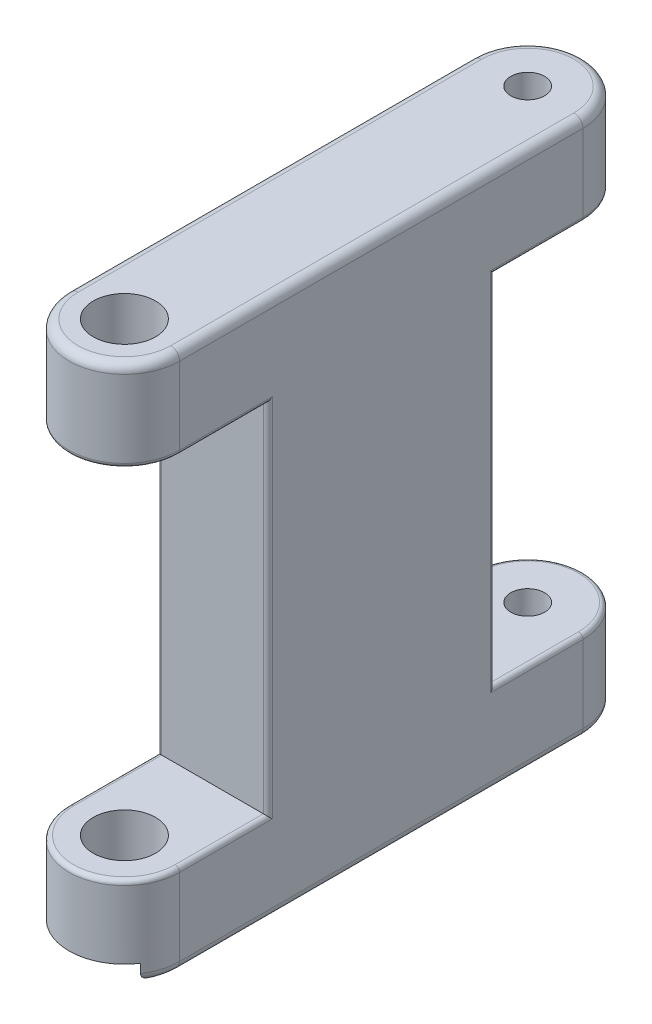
ISO-10303-21;
HEADER;
FILE_DESCRIPTION(('STEP AP214'),'2;1');
FILE_NAME('part.step','',(''),(''),'','','');
FILE_SCHEMA(('AUTOMOTIVE_DESIGN { 1 0 10303 214 1 1 1 1 }'));
ENDSEC;
DATA;
#1=APPLICATION_CONTEXT('core data for automotive mechanical design processes');
#2=APPLICATION_PROTOCOL_DEFINITION('international standard','automotive_design',2000,#1);
#3=PRODUCT_CONTEXT('',#1,'mechanical');
#4=PRODUCT('Part','Part','',(#3));
#5=PRODUCT_RELATED_PRODUCT_CATEGORY('part','',(#4));
#6=PRODUCT_DEFINITION_FORMATION('','',#4);
#7=PRODUCT_DEFINITION_CONTEXT('part definition',#1,'design');
#8=PRODUCT_DEFINITION('design','',#6,#7);
#9=PRODUCT_DEFINITION_SHAPE('','',#8);
#10=(LENGTH_UNIT() NAMED_UNIT(*) SI_UNIT(.MILLI.,.METRE.));
#11=(NAMED_UNIT(*) PLANE_ANGLE_UNIT() SI_UNIT($,.RADIAN.));
#12=(NAMED_UNIT(*) SI_UNIT($,.STERADIAN.) SOLID_ANGLE_UNIT());
#13=UNCERTAINTY_MEASURE_WITH_UNIT(LENGTH_MEASURE(1.E-05),#10,'distance_accuracy_value','');
#14=(GEOMETRIC_REPRESENTATION_CONTEXT(3) GLOBAL_UNCERTAINTY_ASSIGNED_CONTEXT((#13)) GLOBAL_UNIT_ASSIGNED_CONTEXT((#10,
#11,#12)) REPRESENTATION_CONTEXT('',''));
#15=CARTESIAN_POINT('',(0.,0.,0.));
#16=DIRECTION('',(0.,0.,1.));
#17=DIRECTION('',(1.,0.,0.));
#18=AXIS2_PLACEMENT_3D('',#15,#16,#17);
#19=CARTESIAN_POINT('',(0.,60.,45.));
#20=DIRECTION('',(0.,-1.,0.));
#21=DIRECTION('',(0.,0.,-1.));
#22=AXIS2_PLACEMENT_3D('',#19,#20,#21);
#23=CYLINDRICAL_SURFACE('',#22,6.16883116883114);
#24=DIRECTION('',(0.,-1.,0.));
#25=VECTOR('',#24,1.);
#26=CARTESIAN_POINT('',(-6.16883116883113,60.,45.));
#27=LINE('',#26,#25);
#28=CARTESIAN_POINT('',(-6.16883116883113,59.,45.));
#29=VERTEX_POINT('',#28);
#30=CARTESIAN_POINT('',(-6.16883116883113,50.4,45.));
#31=VERTEX_POINT('',#30);
#32=EDGE_CURVE('E352',#29,#31,#27,.T.);
#33=ORIENTED_EDGE('',*,*,#32,.T.);
#34=CARTESIAN_POINT('',(0.,50.4,45.));
#35=DIRECTION('',(0.,1.,0.));
#36=DIRECTION('',(0.,0.,1.));
#37=AXIS2_PLACEMENT_3D('',#34,#35,#36);
#38=CIRCLE('',#37,6.16883116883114);
#39=CARTESIAN_POINT('',(6.16883116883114,50.4,45.));
#40=VERTEX_POINT('',#39);
#41=EDGE_CURVE('E355',#31,#40,#38,.T.);
#42=ORIENTED_EDGE('',*,*,#41,.T.);
#43=DIRECTION('',(0.,-1.,0.));
#44=VECTOR('',#43,1.);
#45=CARTESIAN_POINT('',(6.16883116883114,60.,45.));
#46=LINE('',#45,#44);
#47=CARTESIAN_POINT('',(6.16883116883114,59.,45.));
#48=VERTEX_POINT('',#47);
#49=EDGE_CURVE('E620',#48,#40,#46,.T.);
#50=ORIENTED_EDGE('',*,*,#49,.F.);
#51=CARTESIAN_POINT('',(0.,59.,45.));
#52=DIRECTION('',(0.,1.,0.));
#53=DIRECTION('',(0.,0.,1.));
#54=AXIS2_PLACEMENT_3D('',#51,#52,#53);
#55=CIRCLE('',#54,6.16883116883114);
#56=EDGE_CURVE('E358',#48,#29,#55,.F.);
#57=ORIENTED_EDGE('',*,*,#56,.T.);
#58=EDGE_LOOP('',(#33,#42,#50,#57));
#59=FACE_BOUND('',#58,.T.);
#60=ADVANCED_FACE('F36',(#59),#23,.T.);
#61=CARTESIAN_POINT('',(0.,-0.344957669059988,45.));
#62=DIRECTION('',(0.,1.,0.));
#63=DIRECTION('',(0.,0.,1.));
#64=AXIS2_PLACEMENT_3D('',#61,#62,#63);
#65=CYLINDRICAL_SURFACE('',#64,3.475);
#66=CARTESIAN_POINT('',(0.,49.9,45.));
#67=DIRECTION('',(0.,1.,0.));
#68=DIRECTION('',(0.,0.,1.));
#69=AXIS2_PLACEMENT_3D('',#66,#67,#68);
#70=CIRCLE('',#69,3.475);
#71=CARTESIAN_POINT('',(0.,49.9,48.475));
#72=VERTEX_POINT('',#71);
#73=EDGE_CURVE('E479',#72,#72,#70,.F.);
#74=ORIENTED_EDGE('',*,*,#73,.T.);
#75=EDGE_LOOP('',(#74));
#76=FACE_BOUND('',#75,.T.);
#77=CARTESIAN_POINT('',(0.,60.,45.));
#78=DIRECTION('',(0.,1.,0.));
#79=DIRECTION('',(0.,0.,1.));
#80=AXIS2_PLACEMENT_3D('',#77,#78,#79);
#81=CIRCLE('',#80,3.475);
#82=CARTESIAN_POINT('',(0.,60.,48.475));
#83=VERTEX_POINT('',#82);
#84=EDGE_CURVE('E490',#83,#83,#81,.T.);
#85=ORIENTED_EDGE('',*,*,#84,.T.);
#86=EDGE_LOOP('',(#85));
#87=FACE_BOUND('',#86,.T.);
#88=ADVANCED_FACE('F342',(#76,#87),#65,.F.);
#89=CARTESIAN_POINT('',(0.,60.,0.));
#90=DIRECTION('',(0.,-1.,0.));
#91=DIRECTION('',(0.,0.,-1.));
#92=AXIS2_PLACEMENT_3D('',#89,#90,#91);
#93=CYLINDRICAL_SURFACE('',#92,6.16883116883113);
#94=DIRECTION('',(0.,-1.,0.));
#95=VECTOR('',#94,1.);
#96=CARTESIAN_POINT('',(6.16883116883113,60.,0.));
#97=LINE('',#96,#95);
#98=CARTESIAN_POINT('',(6.16883116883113,59.,0.));
#99=VERTEX_POINT('',#98);
#100=CARTESIAN_POINT('',(6.16883116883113,50.4,0.));
#101=VERTEX_POINT('',#100);
#102=EDGE_CURVE('E621',#99,#101,#97,.T.);
#103=ORIENTED_EDGE('',*,*,#102,.T.);
#104=CARTESIAN_POINT('',(0.,50.4,0.));
#105=DIRECTION('',(0.,1.,0.));
#106=DIRECTION('',(0.,0.,1.));
#107=AXIS2_PLACEMENT_3D('',#104,#105,#106);
#108=CIRCLE('',#107,6.16883116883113);
#109=CARTESIAN_POINT('',(-6.16883116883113,50.4,0.));
#110=VERTEX_POINT('',#109);
#111=EDGE_CURVE('E476',#101,#110,#108,.T.);
#112=ORIENTED_EDGE('',*,*,#111,.T.);
#113=DIRECTION('',(0.,-1.,0.));
#114=VECTOR('',#113,1.);
#115=CARTESIAN_POINT('',(-6.16883116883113,60.,0.));
#116=LINE('',#115,#114);
#117=CARTESIAN_POINT('',(-6.16883116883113,59.,0.));
#118=VERTEX_POINT('',#117);
#119=EDGE_CURVE('E601',#118,#110,#116,.T.);
#120=ORIENTED_EDGE('',*,*,#119,.F.);
#121=CARTESIAN_POINT('',(0.,59.,0.));
#122=DIRECTION('',(0.,1.,0.));
#123=DIRECTION('',(0.,0.,1.));
#124=AXIS2_PLACEMENT_3D('',#121,#122,#123);
#125=CIRCLE('',#124,6.16883116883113);
#126=EDGE_CURVE('E559',#118,#99,#125,.F.);
#127=ORIENTED_EDGE('',*,*,#126,.T.);
#128=EDGE_LOOP('',(#103,#112,#120,#127));
#129=FACE_BOUND('',#128,.T.);
#130=ADVANCED_FACE('F326',(#129),#93,.T.);
#131=CARTESIAN_POINT('',(0.,-0.344957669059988,0.));
#132=DIRECTION('',(0.,1.,0.));
#133=DIRECTION('',(0.,0.,1.));
#134=AXIS2_PLACEMENT_3D('',#131,#132,#133);
#135=CYLINDRICAL_SURFACE('',#134,1.8875);
#136=CARTESIAN_POINT('',(0.,49.9,0.));
#137=DIRECTION('',(0.,1.,0.));
#138=DIRECTION('',(0.,0.,1.));
#139=AXIS2_PLACEMENT_3D('',#136,#137,#138);
#140=CIRCLE('',#139,1.8875);
#141=CARTESIAN_POINT('',(0.,49.9,1.8875));
#142=VERTEX_POINT('',#141);
#143=EDGE_CURVE('E487',#142,#142,#140,.F.);
#144=ORIENTED_EDGE('',*,*,#143,.T.);
#145=EDGE_LOOP('',(#144));
#146=FACE_BOUND('',#145,.T.);
#147=CARTESIAN_POINT('',(0.,60.,0.));
#148=DIRECTION('',(0.,1.,0.));
#149=DIRECTION('',(0.,0.,1.));
#150=AXIS2_PLACEMENT_3D('',#147,#148,#149);
#151=CIRCLE('',#150,1.8875);
#152=CARTESIAN_POINT('',(0.,60.,1.8875));
#153=VERTEX_POINT('',#152);
#154=EDGE_CURVE('E498',#153,#153,#151,.T.);
#155=ORIENTED_EDGE('',*,*,#154,.T.);
#156=EDGE_LOOP('',(#155));
#157=FACE_BOUND('',#156,.T.);
#158=ADVANCED_FACE('F660',(#146,#157),#135,.F.);
#159=CARTESIAN_POINT('',(0.,1.,45.));
#160=DIRECTION('',(0.,1.,0.));
#161=DIRECTION('',(0.,0.,1.));
#162=AXIS2_PLACEMENT_3D('',#159,#160,#161);
#163=TOROIDAL_SURFACE('',#162,5.16883116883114,1.);
#164=CARTESIAN_POINT('',(-5.16883116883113,0.484866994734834,48.0976046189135));
#165=CARTESIAN_POINT('',(-5.16883116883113,0.429616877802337,48.0330232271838));
#166=CARTESIAN_POINT('',(-5.16883116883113,0.382029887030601,47.9618714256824));
#167=CARTESIAN_POINT('',(-5.16883116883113,0.29907694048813,47.8127221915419));
#168=CARTESIAN_POINT('',(-5.16883116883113,0.263779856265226,47.7346891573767));
#169=CARTESIAN_POINT('',(-5.16883116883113,0.198616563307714,47.5643136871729));
#170=CARTESIAN_POINT('',(-5.16883116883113,0.170120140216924,47.4714586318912));
#171=CARTESIAN_POINT('',(-5.16883116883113,0.122204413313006,47.2833790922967));
#172=CARTESIAN_POINT('',(-5.16883116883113,0.102802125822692,47.1881505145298));
#173=CARTESIAN_POINT('',(-5.16883116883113,0.0706700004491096,46.9961943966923));
#174=CARTESIAN_POINT('',(-5.16883116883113,0.0579693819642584,46.8994621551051));
#175=CARTESIAN_POINT('',(-5.16883116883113,0.0375061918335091,46.705585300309));
#176=CARTESIAN_POINT('',(-5.16883116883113,0.0297397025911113,46.6084410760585));
#177=CARTESIAN_POINT('',(-5.16883116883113,0.0171237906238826,46.4056018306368));
#178=CARTESIAN_POINT('',(-5.16883116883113,0.0125821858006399,46.2998889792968));
#179=CARTESIAN_POINT('',(-5.16883116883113,0.00603996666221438,46.0883792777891));
#180=CARTESIAN_POINT('',(-5.16883116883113,0.00403976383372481,45.9825824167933));
#181=CARTESIAN_POINT('',(-5.16883116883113,0.00141855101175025,45.7709059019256));
#182=CARTESIAN_POINT('',(-5.16883116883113,0.000798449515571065,45.6650262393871));
#183=CARTESIAN_POINT('',(-5.16883116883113,0.000111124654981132,45.4532742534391));
#184=CARTESIAN_POINT('',(-5.16883116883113,4.38597064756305E-05,45.3474019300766));
#185=CARTESIAN_POINT('',(-5.16883116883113,-1.20057176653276E-05,45.1358230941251));
#186=CARTESIAN_POINT('',(-5.16883116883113,-7.29229466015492E-07,45.0301165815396));
#187=CARTESIAN_POINT('',(-5.16883116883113,1.03472445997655E-06,44.8187002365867));
#188=CARTESIAN_POINT('',(-5.16883116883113,-8.47846829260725E-06,44.7129904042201));
#189=CARTESIAN_POINT('',(-5.16883116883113,0.0002303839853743,44.5016112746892));
#190=CARTESIAN_POINT('',(-5.16883116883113,0.00047866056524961,44.395941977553));
#191=CARTESIAN_POINT('',(-5.16883116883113,0.00187477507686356,44.1846109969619));
#192=CARTESIAN_POINT('',(-5.16883116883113,0.00302258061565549,44.0789493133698));
#193=CARTESIAN_POINT('',(-5.16883116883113,0.00720941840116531,43.8672183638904));
#194=CARTESIAN_POINT('',(-5.16883116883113,0.0102562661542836,43.7611492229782));
#195=CARTESIAN_POINT('',(-5.16883116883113,0.0195835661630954,43.5490972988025));
#196=CARTESIAN_POINT('',(-5.16883116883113,0.0258652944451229,43.4431145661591));
#197=CARTESIAN_POINT('',(-5.16883116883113,0.043360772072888,43.2316392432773));
#198=CARTESIAN_POINT('',(-5.16883116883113,0.0545690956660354,43.126146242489));
#199=CARTESIAN_POINT('',(-5.16883116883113,0.0840723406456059,42.9162148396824));
#200=CARTESIAN_POINT('',(-5.16883116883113,0.102360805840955,42.8117755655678));
#201=CARTESIAN_POINT('',(-5.16883116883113,0.149081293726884,42.6039968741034));
#202=CARTESIAN_POINT('',(-5.16883116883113,0.177604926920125,42.5006763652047));
#203=CARTESIAN_POINT('',(-5.16883116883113,0.230902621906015,42.3495174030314));
#204=CARTESIAN_POINT('',(-5.16883116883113,0.250392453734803,42.2998223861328));
#205=CARTESIAN_POINT('',(-5.16883116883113,0.293516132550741,42.2022825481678));
#206=CARTESIAN_POINT('',(-5.16883116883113,0.317146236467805,42.1544361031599));
#207=CARTESIAN_POINT('',(-5.16883116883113,0.36819277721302,42.0633813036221));
#208=CARTESIAN_POINT('',(-5.16883116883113,0.395409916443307,42.0200627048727));
#209=CARTESIAN_POINT('',(-5.16883116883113,0.455032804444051,41.9370800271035));
#210=CARTESIAN_POINT('',(-5.16883116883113,0.487437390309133,41.8974151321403));
#211=CARTESIAN_POINT('',(-5.16883116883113,0.552797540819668,41.829037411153));
#212=CARTESIAN_POINT('',(-5.16883116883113,0.584956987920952,41.7995728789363));
#213=CARTESIAN_POINT('',(-5.16883116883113,0.653622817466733,41.7462071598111));
#214=CARTESIAN_POINT('',(-5.16883116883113,0.690121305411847,41.7222960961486));
#215=CARTESIAN_POINT('',(-5.16883116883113,0.757918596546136,41.6867510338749));
#216=CARTESIAN_POINT('',(-5.16883116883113,0.788391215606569,41.6735497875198));
#217=CARTESIAN_POINT('',(-5.16883116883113,0.851107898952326,41.6523663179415));
#218=CARTESIAN_POINT('',(-5.16883116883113,0.883350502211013,41.6443798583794));
#219=CARTESIAN_POINT('',(-5.16883116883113,0.94891804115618,41.6342482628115));
#220=CARTESIAN_POINT('',(-5.16883116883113,0.982247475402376,41.6321317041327));
#221=CARTESIAN_POINT('',(-5.16883116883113,1.04873339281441,41.6340188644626));
#222=CARTESIAN_POINT('',(-5.16883116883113,1.08188986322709,41.6380230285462));
#223=CARTESIAN_POINT('',(-5.16883116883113,1.14466522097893,41.6512992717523));
#224=CARTESIAN_POINT('',(-5.16883116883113,1.17436882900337,41.6601806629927));
#225=CARTESIAN_POINT('',(-5.16883116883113,1.23208511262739,41.6823029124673));
#226=CARTESIAN_POINT('',(-5.16883116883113,1.26009733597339,41.6955449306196));
#227=CARTESIAN_POINT('',(-5.16883116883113,1.32592479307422,41.7322929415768));
#228=CARTESIAN_POINT('',(-5.16883116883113,1.36264812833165,41.7577530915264));
#229=CARTESIAN_POINT('',(-5.16883116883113,1.43157309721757,41.8142122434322));
#230=CARTESIAN_POINT('',(-5.16883116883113,1.46376222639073,41.8452260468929));
#231=CARTESIAN_POINT('',(-5.16883116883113,1.54042937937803,41.9294265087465));
#232=CARTESIAN_POINT('',(-5.16883116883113,1.58184359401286,41.9853822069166));
#233=CARTESIAN_POINT('',(-5.16883116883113,1.65579791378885,42.102722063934));
#234=CARTESIAN_POINT('',(-5.16883116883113,1.68832838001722,42.1641120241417));
#235=CARTESIAN_POINT('',(-5.16883116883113,1.74467621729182,42.2868220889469));
#236=CARTESIAN_POINT('',(-5.16883116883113,1.76886098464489,42.3479771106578));
#237=CARTESIAN_POINT('',(-5.16883116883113,1.81197133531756,42.4721439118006));
#238=CARTESIAN_POINT('',(-5.16883116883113,1.83089155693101,42.5351575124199));
#239=CARTESIAN_POINT('',(-5.16883116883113,1.86450037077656,42.6626099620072));
#240=CARTESIAN_POINT('',(-5.16883116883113,1.87916786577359,42.727054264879));
#241=CARTESIAN_POINT('',(-5.16883116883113,1.90494562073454,42.8565823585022));
#242=CARTESIAN_POINT('',(-5.16883116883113,1.91605868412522,42.9216656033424));
#243=CARTESIAN_POINT('',(-5.16883116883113,1.93705535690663,43.0632899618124));
#244=CARTESIAN_POINT('',(-5.16883116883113,1.94641330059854,43.1399075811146));
#245=CARTESIAN_POINT('',(-5.16883116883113,1.96210111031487,43.2934586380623));
#246=CARTESIAN_POINT('',(-5.16883116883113,1.96843023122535,43.3703921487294));
#247=CARTESIAN_POINT('',(-5.16883116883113,1.98402919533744,43.6015661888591));
#248=CARTESIAN_POINT('',(-5.16883116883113,1.98989106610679,43.7560259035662));
#249=CARTESIAN_POINT('',(-5.16883116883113,1.99718251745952,44.0656096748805));
#250=CARTESIAN_POINT('',(-5.16883116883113,1.99859433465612,44.2207339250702));
#251=CARTESIAN_POINT('',(-5.16883116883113,1.9999949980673,44.5308875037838));
#252=CARTESIAN_POINT('',(-5.16883116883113,1.99998476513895,44.685916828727));
#253=CARTESIAN_POINT('',(-5.16883116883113,2.00000928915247,44.9964840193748));
#254=CARTESIAN_POINT('',(-5.16883116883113,2.00004419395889,45.1520218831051));
#255=CARTESIAN_POINT('',(-5.16883116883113,1.99987218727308,45.463163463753));
#256=CARTESIAN_POINT('',(-5.16883116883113,1.99966517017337,45.6187671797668));
#257=CARTESIAN_POINT('',(-5.16883116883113,1.99700837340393,45.9295281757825));
#258=CARTESIAN_POINT('',(-5.16883116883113,1.99456507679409,46.0846854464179));
#259=CARTESIAN_POINT('',(-5.16883116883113,1.9865129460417,46.3172408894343));
#260=CARTESIAN_POINT('',(-5.16883116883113,1.98309922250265,46.3947083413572));
#261=CARTESIAN_POINT('',(-5.16883116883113,1.97419543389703,46.5495204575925));
#262=CARTESIAN_POINT('',(-5.16883116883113,1.96870561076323,46.6268651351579));
#263=CARTESIAN_POINT('',(-5.16883116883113,1.95493828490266,46.7814003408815));
#264=CARTESIAN_POINT('',(-5.16883116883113,1.94665774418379,46.858590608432));
#265=CARTESIAN_POINT('',(-5.16883116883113,1.92645048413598,47.012561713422));
#266=CARTESIAN_POINT('',(-5.16883116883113,1.91452130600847,47.0893422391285));
#267=CARTESIAN_POINT('',(-5.16883116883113,1.88609032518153,47.2414770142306));
#268=CARTESIAN_POINT('',(-5.16883116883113,1.86962352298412,47.3168376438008));
#269=CARTESIAN_POINT('',(-5.16883116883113,1.83084330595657,47.4660105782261));
#270=CARTESIAN_POINT('',(-5.16883116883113,1.80853591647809,47.5398243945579));
#271=CARTESIAN_POINT('',(-5.16883116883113,1.76207948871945,47.6692581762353));
#272=CARTESIAN_POINT('',(-5.16883116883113,1.73935357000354,47.7253825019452));
#273=CARTESIAN_POINT('',(-5.16883116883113,1.68828960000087,47.8352681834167));
#274=CARTESIAN_POINT('',(-5.16883116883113,1.65993601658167,47.8890224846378));
#275=CARTESIAN_POINT('',(-5.16883116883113,1.5962135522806,47.9930878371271));
#276=CARTESIAN_POINT('',(-5.16883116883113,1.56077187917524,48.0433551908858));
#277=CARTESIAN_POINT('',(-5.16883116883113,1.48192851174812,48.1371833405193));
#278=CARTESIAN_POINT('',(-5.16883116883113,1.43855874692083,48.1807697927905));
#279=CARTESIAN_POINT('',(-5.16883116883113,1.36264739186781,48.2417531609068));
#280=CARTESIAN_POINT('',(-5.16883116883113,1.33287811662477,48.262590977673));
#281=CARTESIAN_POINT('',(-5.16883116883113,1.27045304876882,48.299441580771));
#282=CARTESIAN_POINT('',(-5.16883116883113,1.2377986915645,48.3154567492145));
#283=CARTESIAN_POINT('',(-5.16883116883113,1.16980513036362,48.3416182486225));
#284=CARTESIAN_POINT('',(-5.16883116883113,1.13444281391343,48.3517057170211));
#285=CARTESIAN_POINT('',(-5.16883116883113,1.0624294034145,48.364771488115));
#286=CARTESIAN_POINT('',(-5.16883116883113,1.02577967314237,48.3677570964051));
#287=CARTESIAN_POINT('',(-5.16883116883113,0.957288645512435,48.366410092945));
#288=CARTESIAN_POINT('',(-5.16883116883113,0.925426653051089,48.3629570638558));
#289=CARTESIAN_POINT('',(-5.16883116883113,0.862753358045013,48.350701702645));
#290=CARTESIAN_POINT('',(-5.16883116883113,0.831942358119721,48.3418978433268));
#291=CARTESIAN_POINT('',(-5.16883116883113,0.772255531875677,48.3196452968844));
#292=CARTESIAN_POINT('',(-5.16883116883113,0.743370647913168,48.3062204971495));
#293=CARTESIAN_POINT('',(-5.16883116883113,0.687759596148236,48.2755013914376));
#294=CARTESIAN_POINT('',(-5.16883116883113,0.661034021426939,48.2582060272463));
#295=CARTESIAN_POINT('',(-5.16883116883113,0.607657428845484,48.2188593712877));
#296=CARTESIAN_POINT('',(-5.16883116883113,0.581217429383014,48.1965243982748));
#297=CARTESIAN_POINT('',(-5.16883116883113,0.531051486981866,48.1490234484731));
#298=CARTESIAN_POINT('',(-5.16883116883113,0.507326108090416,48.1238568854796));
#299=CARTESIAN_POINT('',(-5.16883116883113,0.484866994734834,48.0976046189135));
#300=B_SPLINE_CURVE_WITH_KNOTS('',3,(#164,#165,#166,#167,#168,#169,#170,#171,#172,#173,#174,
#175,#176,#177,#178,#179,#180,#181,#182,#183,#184,#185,#186,#187,#188,#189,#190,#191,#192,#193,
#194,#195,#196,#197,#198,#199,#200,#201,#202,#203,#204,#205,#206,#207,#208,#209,#210,#211,#212,
#213,#214,#215,#216,#217,#218,#219,#220,#221,#222,#223,#224,#225,#226,#227,#228,#229,#230,#231,
#232,#233,#234,#235,#236,#237,#238,#239,#240,#241,#242,#243,#244,#245,#246,#247,#248,#249,#250,
#251,#252,#253,#254,#255,#256,#257,#258,#259,#260,#261,#262,#263,#264,#265,#266,#267,#268,#269,
#270,#271,#272,#273,#274,#275,#276,#277,#278,#279,#280,#281,#282,#283,#284,#285,#286,#287,#288,
#289,#290,#291,#292,#293,#294,#295,#296,#297,#298,#299),.UNSPECIFIED.,.T.,.F.,(4,2,2,2,2,2,2,2,
2,2,2,2,2,2,2,2,2,2,2,2,2,2,2,2,2,2,2,2,2,2,2,2,2,2,2,2,2,2,2,2,2,2,2,2,2,2,2,2,2,2,2,2,2,2,2,2,
2,2,2,2,2,2,2,2,2,2,2,4),(0.,0.254826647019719,0.511059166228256,0.801768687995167,
1.0930200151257,1.38553092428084,1.67780929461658,1.99518986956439,2.31262182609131,
2.63026268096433,2.94787964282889,3.26499916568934,3.58212873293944,3.89913647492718,
4.21613280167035,4.53444241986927,4.8528776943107,5.1709631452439,5.48875922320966,
5.8094737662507,5.96946764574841,6.12931761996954,6.28249304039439,6.43563417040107,
6.56603831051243,6.6962087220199,6.79543829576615,6.89458715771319,6.9942178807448,
7.09385584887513,7.18647962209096,7.27912805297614,7.41242957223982,7.54609180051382,
7.75375998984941,7.96165261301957,8.15864574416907,8.3558387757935,8.5539939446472,
8.75199243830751,8.98347204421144,9.21500856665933,9.6785473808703,10.1439341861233,
10.6090196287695,11.0756324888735,11.5424491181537,12.0079167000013,12.2405245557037,
12.4731053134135,12.7059400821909,12.9389321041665,13.1701749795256,13.4011802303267,
13.5826001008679,13.7645278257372,13.9484298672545,14.1316069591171,14.2402667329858,
14.3488727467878,14.4585397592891,14.5680939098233,14.6637626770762,14.7594587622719,
14.8546674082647,14.9499021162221,15.0534673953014,15.1570541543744),.UNSPECIFIED.);
#301=CARTESIAN_POINT('',(-5.16883116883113,1.,48.367144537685));
#302=VERTEX_POINT('',#301);
#303=CARTESIAN_POINT('',(-5.16883116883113,0.,45.));
#304=VERTEX_POINT('',#303);
#305=EDGE_CURVE('E280',#302,#304,#300,.T.);
#306=ORIENTED_EDGE('',*,*,#305,.F.);
#307=CARTESIAN_POINT('',(0.,1.,45.));
#308=DIRECTION('',(0.,1.,0.));
#309=DIRECTION('',(0.,0.,1.));
#310=AXIS2_PLACEMENT_3D('',#307,#308,#309);
#311=CIRCLE('',#310,6.16883116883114);
#312=CARTESIAN_POINT('',(-6.16883116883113,1.,45.));
#313=VERTEX_POINT('',#312);
#314=EDGE_CURVE('E547',#313,#302,#311,.T.);
#315=ORIENTED_EDGE('',*,*,#314,.F.);
#316=CARTESIAN_POINT('',(-5.16883116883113,1.,45.));
#317=DIRECTION('',(0.,0.,-1.));
#318=DIRECTION('',(-1.,0.,0.));
#319=AXIS2_PLACEMENT_3D('',#316,#317,#318);
#320=CIRCLE('',#319,1.);
#321=EDGE_CURVE('E572',#304,#313,#320,.T.);
#322=ORIENTED_EDGE('',*,*,#321,.F.);
#323=EDGE_LOOP('',(#306,#315,#322));
#324=FACE_BOUND('',#323,.T.);
#325=ADVANCED_FACE('F324',(#324),#163,.T.);
#326=CARTESIAN_POINT('',(-6.16883116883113,9.6,0.));
#327=VERTEX_POINT('',#326);
#328=CARTESIAN_POINT('',(-6.16883116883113,1.,0.));
#329=VERTEX_POINT('',#328);
#330=EDGE_CURVE('E360',#327,#329,#116,.T.);
#331=ORIENTED_EDGE('',*,*,#330,.F.);
#332=CARTESIAN_POINT('',(0.,9.6,0.));
#333=DIRECTION('',(0.,-1.,0.));
#334=DIRECTION('',(0.,0.,-1.));
#335=AXIS2_PLACEMENT_3D('',#332,#333,#334);
#336=CIRCLE('',#335,6.16883116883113);
#337=CARTESIAN_POINT('',(6.16883116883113,9.6,0.));
#338=VERTEX_POINT('',#337);
#339=EDGE_CURVE('E467',#327,#338,#336,.T.);
#340=ORIENTED_EDGE('',*,*,#339,.T.);
#341=CARTESIAN_POINT('',(6.16883116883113,1.,0.));
#342=VERTEX_POINT('',#341);
#343=EDGE_CURVE('E580',#338,#342,#97,.T.);
#344=ORIENTED_EDGE('',*,*,#343,.T.);
#345=CARTESIAN_POINT('',(0.,1.,0.));
#346=DIRECTION('',(0.,1.,0.));
#347=DIRECTION('',(0.,0.,1.));
#348=AXIS2_PLACEMENT_3D('',#345,#346,#347);
#349=CIRCLE('',#348,6.16883116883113);
#350=EDGE_CURVE('E561',#342,#329,#349,.T.);
#351=ORIENTED_EDGE('',*,*,#350,.T.);
#352=EDGE_LOOP('',(#331,#340,#344,#351));
#353=FACE_BOUND('',#352,.T.);
#354=ADVANCED_FACE('F321',(#353),#93,.T.);
#355=CARTESIAN_POINT('',(-6.16883116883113,60.,0.));
#356=DIRECTION('',(1.,0.,0.));
#357=DIRECTION('',(0.,0.,-1.));
#358=AXIS2_PLACEMENT_3D('',#355,#356,#357);
#359=PLANE('',#358);
#360=DIRECTION('',(0.,1.,0.));
#361=VECTOR('',#360,1.);
#362=CARTESIAN_POINT('',(-6.16883116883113,60.,10.3311688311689));
#363=LINE('',#362,#361);
#364=CARTESIAN_POINT('',(-6.16883116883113,50.4,10.3311688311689));
#365=VERTEX_POINT('',#364);
#366=CARTESIAN_POINT('',(-6.16883116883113,9.6,10.3311688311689));
#367=VERTEX_POINT('',#366);
#368=EDGE_CURVE('E439',#365,#367,#363,.F.);
#369=ORIENTED_EDGE('',*,*,#368,.T.);
#370=DIRECTION('',(0.,0.,1.));
#371=VECTOR('',#370,1.);
#372=CARTESIAN_POINT('',(-6.16883116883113,9.6,0.));
#373=LINE('',#372,#371);
#374=EDGE_CURVE('E437',#367,#327,#373,.F.);
#375=ORIENTED_EDGE('',*,*,#374,.T.);
#376=ORIENTED_EDGE('',*,*,#330,.T.);
#377=DIRECTION('',(0.,0.,1.));
#378=VECTOR('',#377,1.);
#379=CARTESIAN_POINT('',(-6.16883116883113,1.,0.));
#380=LINE('',#379,#378);
#381=EDGE_CURVE('E600',#329,#313,#380,.T.);
#382=ORIENTED_EDGE('',*,*,#381,.T.);
#383=CARTESIAN_POINT('',(-6.16883116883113,9.6,45.));
#384=VERTEX_POINT('',#383);
#385=EDGE_CURVE('E361',#384,#313,#27,.T.);
#386=ORIENTED_EDGE('',*,*,#385,.F.);
#387=DIRECTION('',(0.,0.,1.));
#388=VECTOR('',#387,1.);
#389=CARTESIAN_POINT('',(-6.16883116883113,9.6,0.));
#390=LINE('',#389,#388);
#391=CARTESIAN_POINT('',(-6.16883116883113,9.6,34.6688311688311));
#392=VERTEX_POINT('',#391);
#393=EDGE_CURVE('E443',#384,#392,#390,.F.);
#394=ORIENTED_EDGE('',*,*,#393,.T.);
#395=DIRECTION('',(0.,-1.,0.));
#396=VECTOR('',#395,1.);
#397=CARTESIAN_POINT('',(-6.16883116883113,60.,34.6688311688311));
#398=LINE('',#397,#396);
#399=CARTESIAN_POINT('',(-6.16883116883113,50.4,34.6688311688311));
#400=VERTEX_POINT('',#399);
#401=EDGE_CURVE('E446',#392,#400,#398,.F.);
#402=ORIENTED_EDGE('',*,*,#401,.T.);
#403=DIRECTION('',(0.,0.,-1.));
#404=VECTOR('',#403,1.);
#405=CARTESIAN_POINT('',(-6.16883116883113,50.4,0.));
#406=LINE('',#405,#404);
#407=EDGE_CURVE('E379',#400,#31,#406,.F.);
#408=ORIENTED_EDGE('',*,*,#407,.T.);
#409=ORIENTED_EDGE('',*,*,#32,.F.);
#410=DIRECTION('',(0.,0.,1.));
#411=VECTOR('',#410,1.);
#412=CARTESIAN_POINT('',(-6.16883116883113,59.,0.));
#413=LINE('',#412,#411);
#414=EDGE_CURVE('E597',#29,#118,#413,.F.);
#415=ORIENTED_EDGE('',*,*,#414,.T.);
#416=ORIENTED_EDGE('',*,*,#119,.T.);
#417=DIRECTION('',(0.,0.,-1.));
#418=VECTOR('',#417,1.);
#419=CARTESIAN_POINT('',(-6.16883116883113,50.4,0.));
#420=LINE('',#419,#418);
#421=EDGE_CURVE('E441',#110,#365,#420,.F.);
#422=ORIENTED_EDGE('',*,*,#421,.T.);
#423=EDGE_LOOP('',(#369,#375,#376,#382,#386,#394,#402,#408,#409,#415,#416,#422));
#424=FACE_BOUND('',#423,.T.);
#425=ADVANCED_FACE('F317',(#424),#359,.F.);
#426=CARTESIAN_POINT('',(6.16883116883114,9.6,45.));
#427=VERTEX_POINT('',#426);
#428=CARTESIAN_POINT('',(6.16883116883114,1.,45.));
#429=VERTEX_POINT('',#428);
#430=EDGE_CURVE('E617',#427,#429,#46,.T.);
#431=ORIENTED_EDGE('',*,*,#430,.F.);
#432=CARTESIAN_POINT('',(0.,9.6,45.));
#433=DIRECTION('',(0.,-1.,0.));
#434=DIRECTION('',(0.,0.,-1.));
#435=AXIS2_PLACEMENT_3D('',#432,#433,#434);
#436=CIRCLE('',#435,6.16883116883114);
#437=EDGE_CURVE('E458',#427,#384,#436,.T.);
#438=ORIENTED_EDGE('',*,*,#437,.T.);
#439=ORIENTED_EDGE('',*,*,#385,.T.);
#440=ORIENTED_EDGE('',*,*,#314,.T.);
#441=DIRECTION('',(0.,-1.,0.));
#442=VECTOR('',#441,1.);
#443=CARTESIAN_POINT('',(-5.16883116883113,60.,48.367144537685));
#444=LINE('',#443,#442);
#445=CARTESIAN_POINT('',(-5.16883116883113,2.,48.367144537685));
#446=VERTEX_POINT('',#445);
#447=EDGE_CURVE('E289',#302,#446,#444,.F.);
#448=ORIENTED_EDGE('',*,*,#447,.T.);
#449=CARTESIAN_POINT('',(0.,2.,45.));
#450=DIRECTION('',(0.,-1.,0.));
#451=DIRECTION('',(0.,0.,-1.));
#452=AXIS2_PLACEMENT_3D('',#449,#450,#451);
#453=CIRCLE('',#452,6.16883116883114);
#454=CARTESIAN_POINT('',(5.16883116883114,2.,48.3671445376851));
#455=VERTEX_POINT('',#454);
#456=EDGE_CURVE('E241',#455,#446,#453,.T.);
#457=ORIENTED_EDGE('',*,*,#456,.F.);
#458=DIRECTION('',(0.,-1.,0.));
#459=VECTOR('',#458,1.);
#460=CARTESIAN_POINT('',(5.16883116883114,60.,48.3671445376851));
#461=LINE('',#460,#459);
#462=CARTESIAN_POINT('',(5.16883116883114,1.,48.3671445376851));
#463=VERTEX_POINT('',#462);
#464=EDGE_CURVE('E584',#455,#463,#461,.T.);
#465=ORIENTED_EDGE('',*,*,#464,.T.);
#466=EDGE_CURVE('E545',#463,#429,#311,.T.);
#467=ORIENTED_EDGE('',*,*,#466,.T.);
#468=EDGE_LOOP('',(#431,#438,#439,#440,#448,#457,#465,#467));
#469=FACE_BOUND('',#468,.T.);
#470=ADVANCED_FACE('F314',(#469),#23,.T.);
#471=CARTESIAN_POINT('',(6.16883116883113,60.,0.));
#472=DIRECTION('',(-1.,0.,0.));
#473=DIRECTION('',(0.,0.,1.));
#474=AXIS2_PLACEMENT_3D('',#471,#472,#473);
#475=PLANE('',#474);
#476=DIRECTION('',(0.,1.,0.));
#477=VECTOR('',#476,1.);
#478=CARTESIAN_POINT('',(6.16883116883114,60.,10.3311688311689));
#479=LINE('',#478,#477);
#480=CARTESIAN_POINT('',(6.16883116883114,9.6,10.3311688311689));
#481=VERTEX_POINT('',#480);
#482=CARTESIAN_POINT('',(6.16883116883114,50.4,10.3311688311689));
#483=VERTEX_POINT('',#482);
#484=EDGE_CURVE('E45',#481,#483,#479,.T.);
#485=ORIENTED_EDGE('',*,*,#484,.T.);
#486=DIRECTION('',(0.,0.,-1.));
#487=VECTOR('',#486,1.);
#488=CARTESIAN_POINT('',(6.16883116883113,50.4,0.));
#489=LINE('',#488,#487);
#490=EDGE_CURVE('E12',#483,#101,#489,.T.);
#491=ORIENTED_EDGE('',*,*,#490,.T.);
#492=ORIENTED_EDGE('',*,*,#102,.F.);
#493=DIRECTION('',(0.,0.,-1.));
#494=VECTOR('',#493,1.);
#495=CARTESIAN_POINT('',(6.16883116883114,59.,45.));
#496=LINE('',#495,#494);
#497=EDGE_CURVE('E550',#99,#48,#496,.F.);
#498=ORIENTED_EDGE('',*,*,#497,.T.);
#499=ORIENTED_EDGE('',*,*,#49,.T.);
#500=DIRECTION('',(0.,0.,-1.));
#501=VECTOR('',#500,1.);
#502=CARTESIAN_POINT('',(6.16883116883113,50.4,0.));
#503=LINE('',#502,#501);
#504=CARTESIAN_POINT('',(6.16883116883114,50.4,34.6688311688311));
#505=VERTEX_POINT('',#504);
#506=EDGE_CURVE('E427',#40,#505,#503,.T.);
#507=ORIENTED_EDGE('',*,*,#506,.T.);
#508=DIRECTION('',(0.,-1.,0.));
#509=VECTOR('',#508,1.);
#510=CARTESIAN_POINT('',(6.16883116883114,60.,34.6688311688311));
#511=LINE('',#510,#509);
#512=CARTESIAN_POINT('',(6.16883116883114,9.6,34.6688311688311));
#513=VERTEX_POINT('',#512);
#514=EDGE_CURVE('E425',#505,#513,#511,.T.);
#515=ORIENTED_EDGE('',*,*,#514,.T.);
#516=DIRECTION('',(0.,0.,1.));
#517=VECTOR('',#516,1.);
#518=CARTESIAN_POINT('',(6.16883116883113,9.6,0.));
#519=LINE('',#518,#517);
#520=EDGE_CURVE('E423',#513,#427,#519,.T.);
#521=ORIENTED_EDGE('',*,*,#520,.T.);
#522=ORIENTED_EDGE('',*,*,#430,.T.);
#523=DIRECTION('',(0.,0.,-1.));
#524=VECTOR('',#523,1.);
#525=CARTESIAN_POINT('',(6.16883116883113,1.,0.));
#526=LINE('',#525,#524);
#527=EDGE_CURVE('E556',#429,#342,#526,.T.);
#528=ORIENTED_EDGE('',*,*,#527,.T.);
#529=ORIENTED_EDGE('',*,*,#343,.F.);
#530=DIRECTION('',(0.,0.,1.));
#531=VECTOR('',#530,1.);
#532=CARTESIAN_POINT('',(6.16883116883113,9.6,0.));
#533=LINE('',#532,#531);
#534=EDGE_CURVE('E56',#338,#481,#533,.T.);
#535=ORIENTED_EDGE('',*,*,#534,.T.);
#536=EDGE_LOOP('',(#485,#491,#492,#498,#499,#507,#515,#521,#522,#528,#529,#535));
#537=FACE_BOUND('',#536,.T.);
#538=ADVANCED_FACE('F306',(#537),#475,.F.);
#539=CARTESIAN_POINT('',(0.,60.,0.));
#540=DIRECTION('',(0.,1.,0.));
#541=DIRECTION('',(0.,0.,1.));
#542=AXIS2_PLACEMENT_3D('',#539,#540,#541);
#543=PLANE('',#542);
#544=ORIENTED_EDGE('',*,*,#84,.F.);
#545=EDGE_LOOP('',(#544));
#546=FACE_BOUND('',#545,.T.);
#547=ORIENTED_EDGE('',*,*,#154,.F.);
#548=EDGE_LOOP('',(#547));
#549=FACE_BOUND('',#548,.T.);
#550=CARTESIAN_POINT('',(0.,60.,45.));
#551=DIRECTION('',(0.,1.,0.));
#552=DIRECTION('',(0.,0.,1.));
#553=AXIS2_PLACEMENT_3D('',#550,#551,#552);
#554=CIRCLE('',#553,5.16883116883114);
#555=CARTESIAN_POINT('',(-5.16883116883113,60.,45.));
#556=VERTEX_POINT('',#555);
#557=CARTESIAN_POINT('',(5.16883116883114,60.,45.));
#558=VERTEX_POINT('',#557);
#559=EDGE_CURVE('E568',#556,#558,#554,.T.);
#560=ORIENTED_EDGE('',*,*,#559,.T.);
#561=DIRECTION('',(0.,0.,-1.));
#562=VECTOR('',#561,1.);
#563=CARTESIAN_POINT('',(5.16883116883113,60.,0.));
#564=LINE('',#563,#562);
#565=CARTESIAN_POINT('',(5.16883116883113,60.,0.));
#566=VERTEX_POINT('',#565);
#567=EDGE_CURVE('E507',#558,#566,#564,.T.);
#568=ORIENTED_EDGE('',*,*,#567,.T.);
#569=CARTESIAN_POINT('',(0.,60.,0.));
#570=DIRECTION('',(0.,1.,0.));
#571=DIRECTION('',(0.,0.,1.));
#572=AXIS2_PLACEMENT_3D('',#569,#570,#571);
#573=CIRCLE('',#572,5.16883116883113);
#574=CARTESIAN_POINT('',(-5.16883116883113,60.,0.));
#575=VERTEX_POINT('',#574);
#576=EDGE_CURVE('E564',#566,#575,#573,.T.);
#577=ORIENTED_EDGE('',*,*,#576,.T.);
#578=DIRECTION('',(0.,0.,1.));
#579=VECTOR('',#578,1.);
#580=CARTESIAN_POINT('',(-5.16883116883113,60.,45.));
#581=LINE('',#580,#579);
#582=EDGE_CURVE('E566',#575,#556,#581,.T.);
#583=ORIENTED_EDGE('',*,*,#582,.T.);
#584=EDGE_LOOP('',(#560,#568,#577,#583));
#585=FACE_BOUND('',#584,.T.);
#586=ADVANCED_FACE('F302',(#546,#549,#585),#543,.T.);
#587=CARTESIAN_POINT('',(0.,0.,0.));
#588=DIRECTION('',(0.,1.,0.));
#589=DIRECTION('',(0.,0.,1.));
#590=AXIS2_PLACEMENT_3D('',#587,#588,#589);
#591=PLANE('',#590);
#592=CARTESIAN_POINT('',(0.,0.,0.));
#593=DIRECTION('',(0.,1.,0.));
#594=DIRECTION('',(0.,0.,1.));
#595=AXIS2_PLACEMENT_3D('',#592,#593,#594);
#596=CIRCLE('',#595,1.8875);
#597=CARTESIAN_POINT('',(0.,0.,1.8875));
#598=VERTEX_POINT('',#597);
#599=EDGE_CURVE('E271',#598,#598,#596,.T.);
#600=ORIENTED_EDGE('',*,*,#599,.T.);
#601=EDGE_LOOP('',(#600));
#602=FACE_BOUND('',#601,.T.);
#603=DIRECTION('',(0.,0.,-1.));
#604=VECTOR('',#603,1.);
#605=CARTESIAN_POINT('',(5.16883116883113,0.,0.));
#606=LINE('',#605,#604);
#607=CARTESIAN_POINT('',(5.16883116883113,0.,0.));
#608=VERTEX_POINT('',#607);
#609=CARTESIAN_POINT('',(5.16883116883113,0.,40.9304698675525));
#610=VERTEX_POINT('',#609);
#611=EDGE_CURVE('E531',#608,#610,#606,.F.);
#612=ORIENTED_EDGE('',*,*,#611,.T.);
#613=DIRECTION('',(0.114801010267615,0.,0.99338850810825));
#614=VECTOR('',#613,1.);
#615=CARTESIAN_POINT('',(2.74999999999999,0.,20.));
#616=LINE('',#615,#614);
#617=CARTESIAN_POINT('',(2.74999999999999,0.,20.));
#618=VERTEX_POINT('',#617);
#619=EDGE_CURVE('E274',#618,#610,#616,.T.);
#620=ORIENTED_EDGE('',*,*,#619,.F.);
#621=DIRECTION('',(1.,0.,0.));
#622=VECTOR('',#621,1.);
#623=CARTESIAN_POINT('',(-2.75000000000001,0.,20.));
#624=LINE('',#623,#622);
#625=CARTESIAN_POINT('',(-2.75000000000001,0.,20.));
#626=VERTEX_POINT('',#625);
#627=EDGE_CURVE('E270',#626,#618,#624,.T.);
#628=ORIENTED_EDGE('',*,*,#627,.F.);
#629=DIRECTION('',(0.114801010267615,0.,-0.99338850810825));
#630=VECTOR('',#629,1.);
#631=CARTESIAN_POINT('',(-5.16883116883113,0.,40.9304698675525));
#632=LINE('',#631,#630);
#633=CARTESIAN_POINT('',(-5.16883116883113,0.,40.9304698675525));
#634=VERTEX_POINT('',#633);
#635=EDGE_CURVE('E268',#634,#626,#632,.T.);
#636=ORIENTED_EDGE('',*,*,#635,.F.);
#637=DIRECTION('',(0.,0.,1.));
#638=VECTOR('',#637,1.);
#639=CARTESIAN_POINT('',(-5.16883116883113,0.,0.));
#640=LINE('',#639,#638);
#641=CARTESIAN_POINT('',(-5.16883116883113,0.,0.));
#642=VERTEX_POINT('',#641);
#643=EDGE_CURVE('E609',#634,#642,#640,.F.);
#644=ORIENTED_EDGE('',*,*,#643,.T.);
#645=CARTESIAN_POINT('',(0.,0.,0.));
#646=DIRECTION('',(0.,1.,0.));
#647=DIRECTION('',(0.,0.,1.));
#648=AXIS2_PLACEMENT_3D('',#645,#646,#647);
#649=CIRCLE('',#648,5.16883116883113);
#650=EDGE_CURVE('E604',#642,#608,#649,.F.);
#651=ORIENTED_EDGE('',*,*,#650,.T.);
#652=EDGE_LOOP('',(#612,#620,#628,#636,#644,#651));
#653=FACE_BOUND('',#652,.T.);
#654=ADVANCED_FACE('F305',(#602,#653),#591,.F.);
#655=CARTESIAN_POINT('',(5.16883116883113,1.,0.));
#656=DIRECTION('',(0.,0.,-1.));
#657=DIRECTION('',(-1.,0.,0.));
#658=AXIS2_PLACEMENT_3D('',#655,#656,#657);
#659=CYLINDRICAL_SURFACE('',#658,1.);
#660=CARTESIAN_POINT('',(5.16883116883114,1.,45.));
#661=DIRECTION('',(0.,0.,1.));
#662=DIRECTION('',(1.,0.,0.));
#663=AXIS2_PLACEMENT_3D('',#660,#661,#662);
#664=CIRCLE('',#663,1.);
#665=CARTESIAN_POINT('',(5.16883116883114,0.,45.));
#666=VERTEX_POINT('',#665);
#667=EDGE_CURVE('E540',#666,#429,#664,.T.);
#668=ORIENTED_EDGE('',*,*,#667,.F.);
#669=DIRECTION('',(0.,0.,1.));
#670=VECTOR('',#669,1.);
#671=CARTESIAN_POINT('',(5.16883116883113,0.,40.9304698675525));
#672=LINE('',#671,#670);
#673=EDGE_CURVE('E244',#610,#666,#672,.T.);
#674=ORIENTED_EDGE('',*,*,#673,.F.);
#675=ORIENTED_EDGE('',*,*,#611,.F.);
#676=CARTESIAN_POINT('',(5.16883116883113,1.,0.));
#677=DIRECTION('',(0.,0.,-1.));
#678=DIRECTION('',(-1.,0.,0.));
#679=AXIS2_PLACEMENT_3D('',#676,#677,#678);
#680=CIRCLE('',#679,1.);
#681=EDGE_CURVE('E578',#342,#608,#680,.T.);
#682=ORIENTED_EDGE('',*,*,#681,.F.);
#683=ORIENTED_EDGE('',*,*,#527,.F.);
#684=EDGE_LOOP('',(#668,#674,#675,#682,#683));
#685=FACE_BOUND('',#684,.T.);
#686=ADVANCED_FACE('F310',(#685),#659,.T.);
#687=CARTESIAN_POINT('',(0.,1.,0.));
#688=DIRECTION('',(0.,1.,0.));
#689=DIRECTION('',(0.,0.,1.));
#690=AXIS2_PLACEMENT_3D('',#687,#688,#689);
#691=TOROIDAL_SURFACE('',#690,5.16883116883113,1.);
#692=ORIENTED_EDGE('',*,*,#681,.T.);
#693=ORIENTED_EDGE('',*,*,#650,.F.);
#694=CARTESIAN_POINT('',(-5.16883116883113,1.,0.));
#695=DIRECTION('',(0.,0.,1.));
#696=DIRECTION('',(0.,-1.,0.));
#697=AXIS2_PLACEMENT_3D('',#694,#695,#696);
#698=CIRCLE('',#697,1.);
#699=EDGE_CURVE('E575',#329,#642,#698,.T.);
#700=ORIENTED_EDGE('',*,*,#699,.F.);
#701=ORIENTED_EDGE('',*,*,#350,.F.);
#702=EDGE_LOOP('',(#692,#693,#700,#701));
#703=FACE_BOUND('',#702,.T.);
#704=ADVANCED_FACE('F338',(#703),#691,.T.);
#705=CARTESIAN_POINT('',(5.16883116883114,0.484866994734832,48.0976046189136));
#706=CARTESIAN_POINT('',(5.16883116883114,0.511246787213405,48.1284460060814));
#707=CARTESIAN_POINT('',(5.16883116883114,0.539388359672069,48.157794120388));
#708=CARTESIAN_POINT('',(5.16883116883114,0.599443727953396,48.2124052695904));
#709=CARTESIAN_POINT('',(5.16883116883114,0.631356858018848,48.2376690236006));
#710=CARTESIAN_POINT('',(5.16883116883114,0.699350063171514,48.2829576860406));
#711=CARTESIAN_POINT('',(5.16883116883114,0.735476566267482,48.3029143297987));
#712=CARTESIAN_POINT('',(5.16883116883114,0.810932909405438,48.335414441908));
#713=CARTESIAN_POINT('',(5.16883116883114,0.850256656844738,48.3479716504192));
#714=CARTESIAN_POINT('',(5.16883116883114,0.925787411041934,48.36325598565));
#715=CARTESIAN_POINT('',(5.16883116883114,0.961787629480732,48.3669972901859));
#716=CARTESIAN_POINT('',(5.16883116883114,1.03381489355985,48.3672829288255));
#717=CARTESIAN_POINT('',(5.16883116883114,1.06984192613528,48.3638296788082));
#718=CARTESIAN_POINT('',(5.16883116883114,1.1355753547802,48.3510728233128));
#719=CARTESIAN_POINT('',(5.16883116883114,1.165460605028,48.3426557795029));
#720=CARTESIAN_POINT('',(5.16883116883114,1.22358603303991,48.3213826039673));
#721=CARTESIAN_POINT('',(5.16883116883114,1.2518259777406,48.3085258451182));
#722=CARTESIAN_POINT('',(5.16883116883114,1.31761577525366,48.2729493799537));
#723=CARTESIAN_POINT('',(5.16883116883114,1.35414853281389,48.2483517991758));
#724=CARTESIAN_POINT('',(5.16883116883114,1.42282072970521,48.1936269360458));
#725=CARTESIAN_POINT('',(5.16883116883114,1.45494840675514,48.1634853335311));
#726=CARTESIAN_POINT('',(5.16883116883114,1.53124349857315,48.0818409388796));
#727=CARTESIAN_POINT('',(5.16883116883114,1.57248328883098,48.0276224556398));
#728=CARTESIAN_POINT('',(5.16883116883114,1.64632573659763,47.9137375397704));
#729=CARTESIAN_POINT('',(5.16883116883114,1.67891829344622,47.8540648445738));
#730=CARTESIAN_POINT('',(5.16883116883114,1.73525815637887,47.7352344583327));
#731=CARTESIAN_POINT('',(5.16883116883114,1.75942741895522,47.6762725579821));
#732=CARTESIAN_POINT('',(5.16883116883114,1.8026825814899,47.5564830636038));
#733=CARTESIAN_POINT('',(5.16883116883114,1.82176338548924,47.4956536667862));
#734=CARTESIAN_POINT('',(5.16883116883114,1.85580984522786,47.3725631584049));
#735=CARTESIAN_POINT('',(5.16883116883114,1.87075544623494,47.310296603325));
#736=CARTESIAN_POINT('',(5.16883116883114,1.89716295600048,47.1850945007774));
#737=CARTESIAN_POINT('',(5.16883116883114,1.90862757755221,47.1221595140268));
#738=CARTESIAN_POINT('',(5.16883116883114,1.93038155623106,46.985452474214));
#739=CARTESIAN_POINT('',(5.16883116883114,1.94016694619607,46.9116015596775));
#740=CARTESIAN_POINT('',(5.16883116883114,1.95673468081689,46.7635572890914));
#741=CARTESIAN_POINT('',(5.16883116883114,1.96351627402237,46.6893638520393));
#742=CARTESIAN_POINT('',(5.16883116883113,1.98044181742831,46.4663821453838));
#743=CARTESIAN_POINT('',(5.16883116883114,1.98714578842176,46.3173426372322));
#744=CARTESIAN_POINT('',(5.16883116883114,1.99579907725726,46.0185948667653));
#745=CARTESIAN_POINT('',(5.16883116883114,1.99772947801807,45.8688862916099));
#746=CARTESIAN_POINT('',(5.16883116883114,1.99978912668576,45.5695520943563));
#747=CARTESIAN_POINT('',(5.16883116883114,1.99991948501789,45.41992647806));
#748=CARTESIAN_POINT('',(5.16883116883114,2.00003066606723,45.1205820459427));
#749=CARTESIAN_POINT('',(5.16883116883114,2.00001139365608,44.9708632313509));
#750=CARTESIAN_POINT('',(5.16883116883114,1.99997903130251,44.6713778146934));
#751=CARTESIAN_POINT('',(5.16883116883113,1.999965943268,44.5216112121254));
#752=CARTESIAN_POINT('',(5.16883116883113,1.99858891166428,44.2224251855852));
#753=CARTESIAN_POINT('',(5.16883116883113,1.99722804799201,44.0730057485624));
#754=CARTESIAN_POINT('',(5.16883116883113,1.99043918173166,43.7742731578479));
#755=CARTESIAN_POINT('',(5.16883116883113,1.98501288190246,43.6249599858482));
#756=CARTESIAN_POINT('',(5.16883116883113,1.97157166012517,43.4144389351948));
#757=CARTESIAN_POINT('',(5.16883116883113,1.96695214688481,43.3530218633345));
#758=CARTESIAN_POINT('',(5.16883116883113,1.9559418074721,43.2303262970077));
#759=CARTESIAN_POINT('',(5.16883116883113,1.94955050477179,43.1690478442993));
#760=CARTESIAN_POINT('',(5.16883116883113,1.93456771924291,43.0466363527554));
#761=CARTESIAN_POINT('',(5.16883116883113,1.92597206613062,42.9855038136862));
#762=CARTESIAN_POINT('',(5.16883116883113,1.90609598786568,42.8636775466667));
#763=CARTESIAN_POINT('',(5.16883116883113,1.89481594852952,42.8029837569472));
#764=CARTESIAN_POINT('',(5.16883116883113,1.8687942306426,42.6813514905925));
#765=CARTESIAN_POINT('',(5.16883116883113,1.85400188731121,42.6204236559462));
#766=CARTESIAN_POINT('',(5.16883116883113,1.82033641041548,42.4997112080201));
#767=CARTESIAN_POINT('',(5.16883116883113,1.80146501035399,42.4399261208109));
#768=CARTESIAN_POINT('',(5.16883116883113,1.75886795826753,42.322405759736));
#769=CARTESIAN_POINT('',(5.16883116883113,1.73516596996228,42.2646620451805));
#770=CARTESIAN_POINT('',(5.16883116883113,1.68184400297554,42.1520167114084));
#771=CARTESIAN_POINT('',(5.16883116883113,1.65223468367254,42.0971101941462));
#772=CARTESIAN_POINT('',(5.16883116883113,1.59579821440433,42.0074944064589));
#773=CARTESIAN_POINT('',(5.16883116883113,1.57078232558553,41.9716514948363));
#774=CARTESIAN_POINT('',(5.16883116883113,1.51677763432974,41.9030053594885));
#775=CARTESIAN_POINT('',(5.16883116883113,1.48778643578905,41.8702039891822));
#776=CARTESIAN_POINT('',(5.16883116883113,1.42517896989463,41.8086012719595));
#777=CARTESIAN_POINT('',(5.16883116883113,1.39151912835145,41.77984346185));
#778=CARTESIAN_POINT('',(5.16883116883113,1.31975274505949,41.7285138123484));
#779=CARTESIAN_POINT('',(5.16883116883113,1.28165544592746,41.7059294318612));
#780=CARTESIAN_POINT('',(5.16883116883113,1.212244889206,41.6738912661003));
#781=CARTESIAN_POINT('',(5.16883116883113,1.18180821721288,41.6625439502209));
#782=CARTESIAN_POINT('',(5.16883116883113,1.11946774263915,41.6450701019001));
#783=CARTESIAN_POINT('',(5.16883116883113,1.08756519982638,41.638939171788));
#784=CARTESIAN_POINT('',(5.16883116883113,1.02305566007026,41.6323824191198));
#785=CARTESIAN_POINT('',(5.16883116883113,0.990446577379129,41.6319767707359));
#786=CARTESIAN_POINT('',(5.16883116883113,0.925672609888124,41.6369587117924));
#787=CARTESIAN_POINT('',(5.16883116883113,0.89350784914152,41.6423478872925));
#788=CARTESIAN_POINT('',(5.16883116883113,0.832004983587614,41.6580976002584));
#789=CARTESIAN_POINT('',(5.16883116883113,0.802604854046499,41.6682208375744));
#790=CARTESIAN_POINT('',(5.16883116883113,0.745629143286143,41.6926658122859));
#791=CARTESIAN_POINT('',(5.16883116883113,0.718053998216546,41.7069885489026));
#792=CARTESIAN_POINT('',(5.16883116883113,0.651950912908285,41.7470238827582));
#793=CARTESIAN_POINT('',(5.16883116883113,0.614716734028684,41.7748720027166));
#794=CARTESIAN_POINT('',(5.16883116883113,0.545118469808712,41.8361329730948));
#795=CARTESIAN_POINT('',(5.16883116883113,0.512769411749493,41.8695623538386));
#796=CARTESIAN_POINT('',(5.16883116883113,0.435111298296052,41.9609219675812));
#797=CARTESIAN_POINT('',(5.16883116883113,0.39325595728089,42.0217655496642));
#798=CARTESIAN_POINT('',(5.16883116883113,0.31909216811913,42.1487995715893));
#799=CARTESIAN_POINT('',(5.16883116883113,0.286788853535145,42.2149928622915));
#800=CARTESIAN_POINT('',(5.16883116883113,0.230533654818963,42.3487043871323));
#801=CARTESIAN_POINT('',(5.16883116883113,0.206382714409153,42.4161407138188));
#802=CARTESIAN_POINT('',(5.16883116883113,0.16383343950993,42.5528379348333));
#803=CARTESIAN_POINT('',(5.16883116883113,0.145441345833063,42.6221007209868));
#804=CARTESIAN_POINT('',(5.16883116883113,0.113174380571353,42.7621646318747));
#805=CARTESIAN_POINT('',(5.16883116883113,0.0993325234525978,42.8329731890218));
#806=CARTESIAN_POINT('',(5.16883116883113,0.0754056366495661,42.975138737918));
#807=CARTESIAN_POINT('',(5.16883116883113,0.0653171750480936,43.0464951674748));
#808=CARTESIAN_POINT('',(5.16883116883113,0.046418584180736,43.2034547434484));
#809=CARTESIAN_POINT('',(5.16883116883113,0.0382378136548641,43.2891318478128));
#810=CARTESIAN_POINT('',(5.16883116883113,0.0249816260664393,43.4607323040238));
#811=CARTESIAN_POINT('',(5.16883116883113,0.0199069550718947,43.5466557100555));
#812=CARTESIAN_POINT('',(5.16883116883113,0.0119577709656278,43.7186849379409));
#813=CARTESIAN_POINT('',(5.16883116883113,0.00908548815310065,43.8047908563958));
#814=CARTESIAN_POINT('',(5.16883116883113,0.00480428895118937,43.9770400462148));
#815=CARTESIAN_POINT('',(5.16883116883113,0.00339545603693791,44.0631833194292));
#816=CARTESIAN_POINT('',(5.16883116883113,0.00144001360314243,44.2359336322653));
#817=CARTESIAN_POINT('',(5.16883116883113,0.000898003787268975,44.3225407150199));
#818=CARTESIAN_POINT('',(5.16883116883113,0.000235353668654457,44.4957571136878));
#819=CARTESIAN_POINT('',(5.16883116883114,0.000114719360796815,44.5823664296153));
#820=CARTESIAN_POINT('',(5.16883116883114,-2.54153433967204E-06,44.7555127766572));
#821=CARTESIAN_POINT('',(5.16883116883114,7.28469102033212E-07,44.8420498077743));
#822=CARTESIAN_POINT('',(5.16883116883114,-4.85115619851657E-07,45.0151230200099));
#823=CARTESIAN_POINT('',(5.16883116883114,-4.96862735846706E-06,45.1016592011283));
#824=CARTESIAN_POINT('',(5.16883116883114,1.66351019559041E-05,45.2742226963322));
#825=CARTESIAN_POINT('',(5.16883116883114,4.25427287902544E-05,45.3602500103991));
#826=CARTESIAN_POINT('',(5.16883116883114,0.000327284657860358,45.5323038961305));
#827=CARTESIAN_POINT('',(5.16883116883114,0.000586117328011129,45.618330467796));
#828=CARTESIAN_POINT('',(5.16883116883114,0.00169793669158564,45.790494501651));
#829=CARTESIAN_POINT('',(5.16883116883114,0.00255170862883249,45.8766319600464));
#830=CARTESIAN_POINT('',(5.16883116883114,0.00536693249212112,46.0488881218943));
#831=CARTESIAN_POINT('',(5.16883116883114,0.00732834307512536,46.1350068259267));
#832=CARTESIAN_POINT('',(5.16883116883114,0.0129978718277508,46.3065620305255));
#833=CARTESIAN_POINT('',(5.16883116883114,0.0166931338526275,46.391998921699));
#834=CARTESIAN_POINT('',(5.16883116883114,0.0266189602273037,46.562720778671));
#835=CARTESIAN_POINT('',(5.16883116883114,0.0328491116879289,46.6480057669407));
#836=CARTESIAN_POINT('',(5.16883116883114,0.0487923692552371,46.8180891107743));
#837=CARTESIAN_POINT('',(5.16883116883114,0.058498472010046,46.9028880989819));
#838=CARTESIAN_POINT('',(5.16883116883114,0.0825567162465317,47.0718110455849));
#839=CARTESIAN_POINT('',(5.16883116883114,0.0969062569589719,47.1559353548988));
#840=CARTESIAN_POINT('',(5.16883116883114,0.12514577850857,47.2914315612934));
#841=CARTESIAN_POINT('',(5.16883116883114,0.137168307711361,47.343191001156));
#842=CARTESIAN_POINT('',(5.16883116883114,0.164027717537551,47.4460387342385));
#843=CARTESIAN_POINT('',(5.16883116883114,0.178867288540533,47.4971263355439));
#844=CARTESIAN_POINT('',(5.16883116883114,0.211761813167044,47.5979559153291));
#845=CARTESIAN_POINT('',(5.16883116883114,0.229798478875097,47.6477037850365));
#846=CARTESIAN_POINT('',(5.16883116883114,0.269708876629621,47.745611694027));
#847=CARTESIAN_POINT('',(5.16883116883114,0.291579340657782,47.7937730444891));
#848=CARTESIAN_POINT('',(5.16883116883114,0.339158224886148,47.8864723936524));
#849=CARTESIAN_POINT('',(5.16883116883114,0.36474029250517,47.9310744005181));
#850=CARTESIAN_POINT('',(5.16883116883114,0.42089475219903,48.0171177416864));
#851=CARTESIAN_POINT('',(5.16883116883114,0.451468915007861,48.0585579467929));
#852=CARTESIAN_POINT('',(5.16883116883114,0.484866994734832,48.0976046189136));
#853=B_SPLINE_CURVE_WITH_KNOTS('',3,(#705,#706,#707,#708,#709,#710,#711,#712,#713,#714,#715,
#716,#717,#718,#719,#720,#721,#722,#723,#724,#725,#726,#727,#728,#729,#730,#731,#732,#733,#734,
#735,#736,#737,#738,#739,#740,#741,#742,#743,#744,#745,#746,#747,#748,#749,#750,#751,#752,#753,
#754,#755,#756,#757,#758,#759,#760,#761,#762,#763,#764,#765,#766,#767,#768,#769,#770,#771,#772,
#773,#774,#775,#776,#777,#778,#779,#780,#781,#782,#783,#784,#785,#786,#787,#788,#789,#790,#791,
#792,#793,#794,#795,#796,#797,#798,#799,#800,#801,#802,#803,#804,#805,#806,#807,#808,#809,#810,
#811,#812,#813,#814,#815,#816,#817,#818,#819,#820,#821,#822,#823,#824,#825,#826,#827,#828,#829,
#830,#831,#832,#833,#834,#835,#836,#837,#838,#839,#840,#841,#842,#843,#844,#845,#846,#847,#848,
#849,#850,#851,#852),.UNSPECIFIED.,.T.,.F.,(4,2,2,2,2,2,2,2,2,2,2,2,2,2,2,2,2,2,2,2,2,2,2,2,2,2,
2,2,2,2,2,2,2,2,2,2,2,2,2,2,2,2,2,2,2,2,2,2,2,2,2,2,2,2,2,2,2,2,2,2,2,2,2,2,2,2,2,2,2,2,2,2,2,
4),(0.,0.121674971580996,0.243328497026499,0.366478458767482,0.489399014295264,
0.597290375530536,0.705145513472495,0.797903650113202,0.890674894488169,1.0220580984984,
1.1537855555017,1.35699712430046,1.56044502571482,1.75132834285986,1.94240211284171,
2.13438691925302,2.32622172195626,2.54962888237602,2.77309190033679,3.22047172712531,
3.6696216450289,4.11849447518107,4.56765270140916,5.0169494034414,5.46522174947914,
5.91330644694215,6.09805782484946,6.28285894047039,6.46801228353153,6.65313903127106,
6.84111855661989,7.02901835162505,7.21601889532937,7.40268501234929,7.53358767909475,
7.66456959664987,7.79686854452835,7.92889670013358,8.02594750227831,8.12291640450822,
8.22022691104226,8.3175640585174,8.41047332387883,8.50340471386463,8.64210188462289,
8.78121737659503,9.00151750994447,9.22193582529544,9.43649882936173,9.65129355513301,
9.8676139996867,10.08373616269,10.3418556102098,10.600037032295,10.8584795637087,
11.1169368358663,11.3767610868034,11.636589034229,11.8962001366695,12.1558086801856,
12.4138906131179,12.6719707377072,12.9303921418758,13.1888039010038,13.4453291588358,
13.7018126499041,13.9577822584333,14.2136087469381,14.372958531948,14.5324612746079,
14.6910794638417,14.8495630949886,15.0035546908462,15.1576010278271),.UNSPECIFIED.);
#854=EDGE_CURVE('E502',#666,#463,#853,.T.);
#855=ORIENTED_EDGE('',*,*,#854,.F.);
#856=ORIENTED_EDGE('',*,*,#667,.T.);
#857=ORIENTED_EDGE('',*,*,#466,.F.);
#858=EDGE_LOOP('',(#855,#856,#857));
#859=FACE_BOUND('',#858,.T.);
#860=ADVANCED_FACE('F291',(#859),#163,.T.);
#861=CARTESIAN_POINT('',(-5.16883116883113,1.,0.));
#862=DIRECTION('',(0.,0.,1.));
#863=DIRECTION('',(1.,0.,0.));
#864=AXIS2_PLACEMENT_3D('',#861,#862,#863);
#865=CYLINDRICAL_SURFACE('',#864,1.);
#866=ORIENTED_EDGE('',*,*,#699,.T.);
#867=ORIENTED_EDGE('',*,*,#643,.F.);
#868=EDGE_CURVE('E250',#304,#634,#640,.F.);
#869=ORIENTED_EDGE('',*,*,#868,.F.);
#870=ORIENTED_EDGE('',*,*,#321,.T.);
#871=ORIENTED_EDGE('',*,*,#381,.F.);
#872=EDGE_LOOP('',(#866,#867,#869,#870,#871));
#873=FACE_BOUND('',#872,.T.);
#874=ADVANCED_FACE('F327',(#873),#865,.T.);
#875=CARTESIAN_POINT('',(-5.16883116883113,59.,0.));
#876=DIRECTION('',(0.,0.,-1.));
#877=DIRECTION('',(-1.,0.,0.));
#878=AXIS2_PLACEMENT_3D('',#875,#876,#877);
#879=CYLINDRICAL_SURFACE('',#878,1.);
#880=CARTESIAN_POINT('',(-5.16883116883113,59.,0.));
#881=DIRECTION('',(0.,0.,-1.));
#882=DIRECTION('',(-1.,0.,0.));
#883=AXIS2_PLACEMENT_3D('',#880,#881,#882);
#884=CIRCLE('',#883,1.);
#885=EDGE_CURVE('E585',#118,#575,#884,.T.);
#886=ORIENTED_EDGE('',*,*,#885,.F.);
#887=ORIENTED_EDGE('',*,*,#414,.F.);
#888=CARTESIAN_POINT('',(-5.16883116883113,59.,45.));
#889=DIRECTION('',(0.,0.,1.));
#890=DIRECTION('',(1.,0.,0.));
#891=AXIS2_PLACEMENT_3D('',#888,#889,#890);
#892=CIRCLE('',#891,1.);
#893=EDGE_CURVE('E508',#556,#29,#892,.T.);
#894=ORIENTED_EDGE('',*,*,#893,.F.);
#895=ORIENTED_EDGE('',*,*,#582,.F.);
#896=EDGE_LOOP('',(#886,#887,#894,#895));
#897=FACE_BOUND('',#896,.T.);
#898=ADVANCED_FACE('F329',(#897),#879,.T.);
#899=CARTESIAN_POINT('',(0.,59.,45.));
#900=DIRECTION('',(0.,1.,0.));
#901=DIRECTION('',(0.,0.,1.));
#902=AXIS2_PLACEMENT_3D('',#899,#900,#901);
#903=TOROIDAL_SURFACE('',#902,5.16883116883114,1.);
#904=ORIENTED_EDGE('',*,*,#893,.T.);
#905=ORIENTED_EDGE('',*,*,#56,.F.);
#906=CARTESIAN_POINT('',(5.16883116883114,59.,45.));
#907=DIRECTION('',(0.,0.,-1.));
#908=DIRECTION('',(-1.,0.,0.));
#909=AXIS2_PLACEMENT_3D('',#906,#907,#908);
#910=CIRCLE('',#909,1.);
#911=EDGE_CURVE('E583',#558,#48,#910,.T.);
#912=ORIENTED_EDGE('',*,*,#911,.F.);
#913=ORIENTED_EDGE('',*,*,#559,.F.);
#914=EDGE_LOOP('',(#904,#905,#912,#913));
#915=FACE_BOUND('',#914,.T.);
#916=ADVANCED_FACE('F335',(#915),#903,.T.);
#917=CARTESIAN_POINT('',(0.,59.,0.));
#918=DIRECTION('',(0.,1.,0.));
#919=DIRECTION('',(0.,0.,1.));
#920=AXIS2_PLACEMENT_3D('',#917,#918,#919);
#921=TOROIDAL_SURFACE('',#920,5.16883116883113,1.);
#922=ORIENTED_EDGE('',*,*,#885,.T.);
#923=ORIENTED_EDGE('',*,*,#576,.F.);
#924=CARTESIAN_POINT('',(5.16883116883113,59.,0.));
#925=DIRECTION('',(0.,0.,1.));
#926=DIRECTION('',(0.,-1.,0.));
#927=AXIS2_PLACEMENT_3D('',#924,#925,#926);
#928=CIRCLE('',#927,1.);
#929=EDGE_CURVE('E581',#99,#566,#928,.T.);
#930=ORIENTED_EDGE('',*,*,#929,.F.);
#931=ORIENTED_EDGE('',*,*,#126,.F.);
#932=EDGE_LOOP('',(#922,#923,#930,#931));
#933=FACE_BOUND('',#932,.T.);
#934=ADVANCED_FACE('F668',(#933),#921,.T.);
#935=CARTESIAN_POINT('',(5.16883116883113,59.,0.));
#936=DIRECTION('',(0.,0.,1.));
#937=DIRECTION('',(1.,0.,0.));
#938=AXIS2_PLACEMENT_3D('',#935,#936,#937);
#939=CYLINDRICAL_SURFACE('',#938,1.);
#940=ORIENTED_EDGE('',*,*,#911,.T.);
#941=ORIENTED_EDGE('',*,*,#497,.F.);
#942=ORIENTED_EDGE('',*,*,#929,.T.);
#943=ORIENTED_EDGE('',*,*,#567,.F.);
#944=EDGE_LOOP('',(#940,#941,#942,#943));
#945=FACE_BOUND('',#944,.T.);
#946=ADVANCED_FACE('F666',(#945),#939,.T.);
#947=CARTESIAN_POINT('',(0.,2.,0.));
#948=DIRECTION('',(0.,-1.,0.));
#949=DIRECTION('',(0.,0.,-1.));
#950=AXIS2_PLACEMENT_3D('',#947,#948,#949);
#951=PLANE('',#950);
#952=CARTESIAN_POINT('',(0.,2.,45.));
#953=DIRECTION('',(0.,-1.,0.));
#954=DIRECTION('',(0.,0.,-1.));
#955=AXIS2_PLACEMENT_3D('',#952,#953,#954);
#956=CIRCLE('',#955,3.475);
#957=CARTESIAN_POINT('',(0.,2.,41.525));
#958=VERTEX_POINT('',#957);
#959=EDGE_CURVE('E495',#958,#958,#956,.T.);
#960=ORIENTED_EDGE('',*,*,#959,.F.);
#961=EDGE_LOOP('',(#960));
#962=FACE_BOUND('',#961,.T.);
#963=ORIENTED_EDGE('',*,*,#456,.T.);
#964=DIRECTION('',(0.,0.,-1.));
#965=VECTOR('',#964,1.);
#966=CARTESIAN_POINT('',(-5.16883116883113,2.,52.628952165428));
#967=LINE('',#966,#965);
#968=CARTESIAN_POINT('',(-5.16883116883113,2.,40.9304698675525));
#969=VERTEX_POINT('',#968);
#970=EDGE_CURVE('E233',#446,#969,#967,.T.);
#971=ORIENTED_EDGE('',*,*,#970,.T.);
#972=DIRECTION('',(0.114801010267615,0.,-0.99338850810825));
#973=VECTOR('',#972,1.);
#974=CARTESIAN_POINT('',(-5.16883116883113,2.,40.9304698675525));
#975=LINE('',#974,#973);
#976=CARTESIAN_POINT('',(-2.75000000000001,2.,20.));
#977=VERTEX_POINT('',#976);
#978=EDGE_CURVE('E238',#969,#977,#975,.T.);
#979=ORIENTED_EDGE('',*,*,#978,.T.);
#980=DIRECTION('',(1.,0.,0.));
#981=VECTOR('',#980,1.);
#982=CARTESIAN_POINT('',(-2.75000000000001,2.,20.));
#983=LINE('',#982,#981);
#984=CARTESIAN_POINT('',(2.74999999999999,2.,20.));
#985=VERTEX_POINT('',#984);
#986=EDGE_CURVE('E259',#977,#985,#983,.T.);
#987=ORIENTED_EDGE('',*,*,#986,.T.);
#988=DIRECTION('',(0.114801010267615,0.,0.99338850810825));
#989=VECTOR('',#988,1.);
#990=CARTESIAN_POINT('',(2.74999999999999,2.,20.));
#991=LINE('',#990,#989);
#992=CARTESIAN_POINT('',(5.16883116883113,2.,40.9304698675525));
#993=VERTEX_POINT('',#992);
#994=EDGE_CURVE('E261',#985,#993,#991,.T.);
#995=ORIENTED_EDGE('',*,*,#994,.T.);
#996=DIRECTION('',(0.,0.,1.));
#997=VECTOR('',#996,1.);
#998=CARTESIAN_POINT('',(5.16883116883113,2.,40.9304698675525));
#999=LINE('',#998,#997);
#1000=EDGE_CURVE('E255',#993,#455,#999,.T.);
#1001=ORIENTED_EDGE('',*,*,#1000,.T.);
#1002=EDGE_LOOP('',(#963,#971,#979,#987,#995,#1001));
#1003=FACE_BOUND('',#1002,.T.);
#1004=ADVANCED_FACE('F235',(#962,#1003),#951,.T.);
#1005=CARTESIAN_POINT('',(5.16883116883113,2.,40.9304698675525));
#1006=DIRECTION('',(1.,0.,0.));
#1007=DIRECTION('',(0.,0.,-1.));
#1008=AXIS2_PLACEMENT_3D('',#1005,#1006,#1007);
#1009=PLANE('',#1008);
#1010=ORIENTED_EDGE('',*,*,#1000,.F.);
#1011=DIRECTION('',(0.,-1.,0.));
#1012=VECTOR('',#1011,1.);
#1013=CARTESIAN_POINT('',(5.16883116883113,2.,40.9304698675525));
#1014=LINE('',#1013,#1012);
#1015=EDGE_CURVE('E278',#993,#610,#1014,.T.);
#1016=ORIENTED_EDGE('',*,*,#1015,.T.);
#1017=ORIENTED_EDGE('',*,*,#673,.T.);
#1018=ORIENTED_EDGE('',*,*,#854,.T.);
#1019=ORIENTED_EDGE('',*,*,#464,.F.);
#1020=EDGE_LOOP('',(#1010,#1016,#1017,#1018,#1019));
#1021=FACE_BOUND('',#1020,.T.);
#1022=ADVANCED_FACE('F300',(#1021),#1009,.F.);
#1023=CARTESIAN_POINT('',(-5.16883116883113,2.,52.628952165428));
#1024=DIRECTION('',(-1.,0.,0.));
#1025=DIRECTION('',(0.,0.,1.));
#1026=AXIS2_PLACEMENT_3D('',#1023,#1024,#1025);
#1027=PLANE('',#1026);
#1028=ORIENTED_EDGE('',*,*,#305,.T.);
#1029=ORIENTED_EDGE('',*,*,#868,.T.);
#1030=DIRECTION('',(0.,-1.,0.));
#1031=VECTOR('',#1030,1.);
#1032=CARTESIAN_POINT('',(-5.16883116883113,2.,40.9304698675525));
#1033=LINE('',#1032,#1031);
#1034=EDGE_CURVE('E247',#969,#634,#1033,.T.);
#1035=ORIENTED_EDGE('',*,*,#1034,.F.);
#1036=ORIENTED_EDGE('',*,*,#970,.F.);
#1037=ORIENTED_EDGE('',*,*,#447,.F.);
#1038=EDGE_LOOP('',(#1028,#1029,#1035,#1036,#1037));
#1039=FACE_BOUND('',#1038,.T.);
#1040=ADVANCED_FACE('F248',(#1039),#1027,.F.);
#1041=CARTESIAN_POINT('',(2.74999999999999,2.,20.));
#1042=DIRECTION('',(0.99338850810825,0.,-0.114801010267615));
#1043=DIRECTION('',(-0.114801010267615,0.,-0.99338850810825));
#1044=AXIS2_PLACEMENT_3D('',#1041,#1042,#1043);
#1045=PLANE('',#1044);
#1046=ORIENTED_EDGE('',*,*,#619,.T.);
#1047=ORIENTED_EDGE('',*,*,#1015,.F.);
#1048=ORIENTED_EDGE('',*,*,#994,.F.);
#1049=DIRECTION('',(0.,-1.,0.));
#1050=VECTOR('',#1049,1.);
#1051=CARTESIAN_POINT('',(2.74999999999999,2.,20.));
#1052=LINE('',#1051,#1050);
#1053=EDGE_CURVE('E281',#985,#618,#1052,.T.);
#1054=ORIENTED_EDGE('',*,*,#1053,.T.);
#1055=EDGE_LOOP('',(#1046,#1047,#1048,#1054));
#1056=FACE_BOUND('',#1055,.T.);
#1057=ADVANCED_FACE('F299',(#1056),#1045,.F.);
#1058=CARTESIAN_POINT('',(-2.75000000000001,2.,20.));
#1059=DIRECTION('',(0.,0.,-1.));
#1060=DIRECTION('',(-1.,0.,0.));
#1061=AXIS2_PLACEMENT_3D('',#1058,#1059,#1060);
#1062=PLANE('',#1061);
#1063=ORIENTED_EDGE('',*,*,#627,.T.);
#1064=ORIENTED_EDGE('',*,*,#1053,.F.);
#1065=ORIENTED_EDGE('',*,*,#986,.F.);
#1066=DIRECTION('',(0.,-1.,0.));
#1067=VECTOR('',#1066,1.);
#1068=CARTESIAN_POINT('',(-2.75000000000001,2.,20.));
#1069=LINE('',#1068,#1067);
#1070=EDGE_CURVE('E254',#977,#626,#1069,.T.);
#1071=ORIENTED_EDGE('',*,*,#1070,.T.);
#1072=EDGE_LOOP('',(#1063,#1064,#1065,#1071));
#1073=FACE_BOUND('',#1072,.T.);
#1074=ADVANCED_FACE('F517',(#1073),#1062,.F.);
#1075=CARTESIAN_POINT('',(-5.16883116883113,2.,40.9304698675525));
#1076=DIRECTION('',(-0.99338850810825,0.,-0.114801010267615));
#1077=DIRECTION('',(-0.114801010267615,0.,0.99338850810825));
#1078=AXIS2_PLACEMENT_3D('',#1075,#1076,#1077);
#1079=PLANE('',#1078);
#1080=ORIENTED_EDGE('',*,*,#635,.T.);
#1081=ORIENTED_EDGE('',*,*,#1070,.F.);
#1082=ORIENTED_EDGE('',*,*,#978,.F.);
#1083=ORIENTED_EDGE('',*,*,#1034,.T.);
#1084=EDGE_LOOP('',(#1080,#1081,#1082,#1083));
#1085=FACE_BOUND('',#1084,.T.);
#1086=ADVANCED_FACE('F257',(#1085),#1079,.F.);
#1087=CARTESIAN_POINT('',(0.,10.1,0.));
#1088=DIRECTION('',(0.,-1.,0.));
#1089=DIRECTION('',(0.,0.,-1.));
#1090=AXIS2_PLACEMENT_3D('',#1087,#1088,#1089);
#1091=CIRCLE('',#1090,1.8875);
#1092=CARTESIAN_POINT('',(0.,10.1,-1.8875));
#1093=VERTEX_POINT('',#1092);
#1094=EDGE_CURVE('E491',#1093,#1093,#1091,.F.);
#1095=ORIENTED_EDGE('',*,*,#1094,.T.);
#1096=EDGE_LOOP('',(#1095));
#1097=FACE_BOUND('',#1096,.T.);
#1098=ORIENTED_EDGE('',*,*,#599,.F.);
#1099=EDGE_LOOP('',(#1098));
#1100=FACE_BOUND('',#1099,.T.);
#1101=ADVANCED_FACE('F524',(#1097,#1100),#135,.F.);
#1102=CARTESIAN_POINT('',(0.,10.1,45.));
#1103=DIRECTION('',(0.,-1.,0.));
#1104=DIRECTION('',(0.,0.,-1.));
#1105=AXIS2_PLACEMENT_3D('',#1102,#1103,#1104);
#1106=CIRCLE('',#1105,3.475);
#1107=CARTESIAN_POINT('',(0.,10.1,41.525));
#1108=VERTEX_POINT('',#1107);
#1109=EDGE_CURVE('E483',#1108,#1108,#1106,.F.);
#1110=ORIENTED_EDGE('',*,*,#1109,.T.);
#1111=EDGE_LOOP('',(#1110));
#1112=FACE_BOUND('',#1111,.T.);
#1113=ORIENTED_EDGE('',*,*,#959,.T.);
#1114=EDGE_LOOP('',(#1113));
#1115=FACE_BOUND('',#1114,.T.);
#1116=ADVANCED_FACE('F349',(#1112,#1115),#65,.F.);
#1117=CARTESIAN_POINT('',(43.8311688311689,49.9,9.83116883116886));
#1118=DIRECTION('',(0.,0.,1.));
#1119=DIRECTION('',(0.,-1.,0.));
#1120=AXIS2_PLACEMENT_3D('',#1117,#1118,#1119);
#1121=PLANE('',#1120);
#1122=DIRECTION('',(-1.,0.,0.));
#1123=VECTOR('',#1122,1.);
#1124=CARTESIAN_POINT('',(43.8311688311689,10.1,9.83116883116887));
#1125=LINE('',#1124,#1123);
#1126=CARTESIAN_POINT('',(5.66883116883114,10.1,9.83116883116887));
#1127=VERTEX_POINT('',#1126);
#1128=CARTESIAN_POINT('',(-5.66883116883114,10.1,9.83116883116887));
#1129=VERTEX_POINT('',#1128);
#1130=EDGE_CURVE('E482',#1127,#1129,#1125,.T.);
#1131=ORIENTED_EDGE('',*,*,#1130,.T.);
#1132=DIRECTION('',(0.,1.,0.));
#1133=VECTOR('',#1132,1.);
#1134=CARTESIAN_POINT('',(-5.66883116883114,49.9,9.83116883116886));
#1135=LINE('',#1134,#1133);
#1136=CARTESIAN_POINT('',(-5.66883116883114,49.9,9.83116883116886));
#1137=VERTEX_POINT('',#1136);
#1138=EDGE_CURVE('E433',#1129,#1137,#1135,.T.);
#1139=ORIENTED_EDGE('',*,*,#1138,.T.);
#1140=DIRECTION('',(-1.,0.,0.));
#1141=VECTOR('',#1140,1.);
#1142=CARTESIAN_POINT('',(43.8311688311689,49.9,9.83116883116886));
#1143=LINE('',#1142,#1141);
#1144=CARTESIAN_POINT('',(5.66883116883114,49.9,9.83116883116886));
#1145=VERTEX_POINT('',#1144);
#1146=EDGE_CURVE('E494',#1145,#1137,#1143,.T.);
#1147=ORIENTED_EDGE('',*,*,#1146,.F.);
#1148=DIRECTION('',(0.,1.,0.));
#1149=VECTOR('',#1148,1.);
#1150=CARTESIAN_POINT('',(5.66883116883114,49.9,9.83116883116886));
#1151=LINE('',#1150,#1149);
#1152=EDGE_CURVE('E435',#1145,#1127,#1151,.F.);
#1153=ORIENTED_EDGE('',*,*,#1152,.T.);
#1154=EDGE_LOOP('',(#1131,#1139,#1147,#1153));
#1155=FACE_BOUND('',#1154,.T.);
#1156=ADVANCED_FACE('F648',(#1155),#1121,.F.);
#1157=CARTESIAN_POINT('',(43.8311688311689,49.9,-13.1258902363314));
#1158=DIRECTION('',(0.,1.,0.));
#1159=DIRECTION('',(0.,0.,1.));
#1160=AXIS2_PLACEMENT_3D('',#1157,#1158,#1159);
#1161=PLANE('',#1160);
#1162=ORIENTED_EDGE('',*,*,#143,.F.);
#1163=EDGE_LOOP('',(#1162));
#1164=FACE_BOUND('',#1163,.T.);
#1165=ORIENTED_EDGE('',*,*,#1146,.T.);
#1166=DIRECTION('',(0.,0.,-1.));
#1167=VECTOR('',#1166,1.);
#1168=CARTESIAN_POINT('',(-5.66883116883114,49.9,-13.1258902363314));
#1169=LINE('',#1168,#1167);
#1170=CARTESIAN_POINT('',(-5.66883116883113,49.9,0.));
#1171=VERTEX_POINT('',#1170);
#1172=EDGE_CURVE('E469',#1137,#1171,#1169,.T.);
#1173=ORIENTED_EDGE('',*,*,#1172,.T.);
#1174=CARTESIAN_POINT('',(0.,49.9,0.));
#1175=DIRECTION('',(0.,1.,0.));
#1176=DIRECTION('',(0.,0.,1.));
#1177=AXIS2_PLACEMENT_3D('',#1174,#1175,#1176);
#1178=CIRCLE('',#1177,5.66883116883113);
#1179=CARTESIAN_POINT('',(5.66883116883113,49.9,0.));
#1180=VERTEX_POINT('',#1179);
#1181=EDGE_CURVE('E471',#1171,#1180,#1178,.F.);
#1182=ORIENTED_EDGE('',*,*,#1181,.T.);
#1183=DIRECTION('',(0.,0.,-1.));
#1184=VECTOR('',#1183,1.);
#1185=CARTESIAN_POINT('',(5.66883116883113,49.9,-13.1258902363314));
#1186=LINE('',#1185,#1184);
#1187=EDGE_CURVE('E474',#1180,#1145,#1186,.F.);
#1188=ORIENTED_EDGE('',*,*,#1187,.T.);
#1189=EDGE_LOOP('',(#1165,#1173,#1182,#1188));
#1190=FACE_BOUND('',#1189,.T.);
#1191=ADVANCED_FACE('F752',(#1164,#1190),#1161,.F.);
#1192=CARTESIAN_POINT('',(43.8311688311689,10.1,-13.1258902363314));
#1193=DIRECTION('',(0.,-1.,0.));
#1194=DIRECTION('',(0.,0.,-1.));
#1195=AXIS2_PLACEMENT_3D('',#1192,#1193,#1194);
#1196=PLANE('',#1195);
#1197=ORIENTED_EDGE('',*,*,#1094,.F.);
#1198=EDGE_LOOP('',(#1197));
#1199=FACE_BOUND('',#1198,.T.);
#1200=CARTESIAN_POINT('',(0.,10.1,0.));
#1201=DIRECTION('',(0.,-1.,0.));
#1202=DIRECTION('',(0.,0.,-1.));
#1203=AXIS2_PLACEMENT_3D('',#1200,#1201,#1202);
#1204=CIRCLE('',#1203,5.66883116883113);
#1205=CARTESIAN_POINT('',(5.66883116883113,10.1,0.));
#1206=VERTEX_POINT('',#1205);
#1207=CARTESIAN_POINT('',(-5.66883116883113,10.1,0.));
#1208=VERTEX_POINT('',#1207);
#1209=EDGE_CURVE('E463',#1206,#1208,#1204,.F.);
#1210=ORIENTED_EDGE('',*,*,#1209,.T.);
#1211=DIRECTION('',(0.,0.,1.));
#1212=VECTOR('',#1211,1.);
#1213=CARTESIAN_POINT('',(-5.66883116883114,10.1,-13.1258902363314));
#1214=LINE('',#1213,#1212);
#1215=EDGE_CURVE('E461',#1208,#1129,#1214,.T.);
#1216=ORIENTED_EDGE('',*,*,#1215,.T.);
#1217=ORIENTED_EDGE('',*,*,#1130,.F.);
#1218=DIRECTION('',(0.,0.,1.));
#1219=VECTOR('',#1218,1.);
#1220=CARTESIAN_POINT('',(5.66883116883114,10.1,-13.1258902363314));
#1221=LINE('',#1220,#1219);
#1222=EDGE_CURVE('E465',#1127,#1206,#1221,.F.);
#1223=ORIENTED_EDGE('',*,*,#1222,.T.);
#1224=EDGE_LOOP('',(#1210,#1216,#1217,#1223));
#1225=FACE_BOUND('',#1224,.T.);
#1226=ADVANCED_FACE('F645',(#1199,#1225),#1196,.F.);
#1227=CARTESIAN_POINT('',(43.8311688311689,49.9,35.1688311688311));
#1228=DIRECTION('',(0.,0.,-1.));
#1229=DIRECTION('',(0.,1.,0.));
#1230=AXIS2_PLACEMENT_3D('',#1227,#1228,#1229);
#1231=PLANE('',#1230);
#1232=DIRECTION('',(-1.,0.,0.));
#1233=VECTOR('',#1232,1.);
#1234=CARTESIAN_POINT('',(43.8311688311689,49.9,35.1688311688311));
#1235=LINE('',#1234,#1233);
#1236=CARTESIAN_POINT('',(5.66883116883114,49.9,35.1688311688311));
#1237=VERTEX_POINT('',#1236);
#1238=CARTESIAN_POINT('',(-5.66883116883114,49.9,35.1688311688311));
#1239=VERTEX_POINT('',#1238);
#1240=EDGE_CURVE('E402',#1237,#1239,#1235,.T.);
#1241=ORIENTED_EDGE('',*,*,#1240,.T.);
#1242=DIRECTION('',(0.,-1.,0.));
#1243=VECTOR('',#1242,1.);
#1244=CARTESIAN_POINT('',(-5.66883116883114,49.9,35.1688311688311));
#1245=LINE('',#1244,#1243);
#1246=CARTESIAN_POINT('',(-5.66883116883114,10.1,35.1688311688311));
#1247=VERTEX_POINT('',#1246);
#1248=EDGE_CURVE('E429',#1239,#1247,#1245,.T.);
#1249=ORIENTED_EDGE('',*,*,#1248,.T.);
#1250=DIRECTION('',(-1.,0.,0.));
#1251=VECTOR('',#1250,1.);
#1252=CARTESIAN_POINT('',(43.8311688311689,10.1,35.1688311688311));
#1253=LINE('',#1252,#1251);
#1254=CARTESIAN_POINT('',(5.66883116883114,10.1,35.1688311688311));
#1255=VERTEX_POINT('',#1254);
#1256=EDGE_CURVE('E486',#1255,#1247,#1253,.T.);
#1257=ORIENTED_EDGE('',*,*,#1256,.F.);
#1258=DIRECTION('',(0.,-1.,0.));
#1259=VECTOR('',#1258,1.);
#1260=CARTESIAN_POINT('',(5.66883116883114,49.9,35.1688311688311));
#1261=LINE('',#1260,#1259);
#1262=EDGE_CURVE('E431',#1255,#1237,#1261,.F.);
#1263=ORIENTED_EDGE('',*,*,#1262,.T.);
#1264=EDGE_LOOP('',(#1241,#1249,#1257,#1263));
#1265=FACE_BOUND('',#1264,.T.);
#1266=ADVANCED_FACE('F760',(#1265),#1231,.F.);
#1267=CARTESIAN_POINT('',(43.8311688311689,49.9,58.1258902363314));
#1268=DIRECTION('',(0.,1.,0.));
#1269=DIRECTION('',(0.,0.,1.));
#1270=AXIS2_PLACEMENT_3D('',#1267,#1268,#1269);
#1271=PLANE('',#1270);
#1272=ORIENTED_EDGE('',*,*,#73,.F.);
#1273=EDGE_LOOP('',(#1272));
#1274=FACE_BOUND('',#1273,.T.);
#1275=CARTESIAN_POINT('',(0.,49.9,45.));
#1276=DIRECTION('',(0.,1.,0.));
#1277=DIRECTION('',(0.,0.,1.));
#1278=AXIS2_PLACEMENT_3D('',#1275,#1276,#1277);
#1279=CIRCLE('',#1278,5.66883116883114);
#1280=CARTESIAN_POINT('',(5.66883116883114,49.9,45.));
#1281=VERTEX_POINT('',#1280);
#1282=CARTESIAN_POINT('',(-5.66883116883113,49.9,45.));
#1283=VERTEX_POINT('',#1282);
#1284=EDGE_CURVE('E449',#1281,#1283,#1279,.F.);
#1285=ORIENTED_EDGE('',*,*,#1284,.T.);
#1286=DIRECTION('',(0.,0.,-1.));
#1287=VECTOR('',#1286,1.);
#1288=CARTESIAN_POINT('',(-5.66883116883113,49.9,58.1258902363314));
#1289=LINE('',#1288,#1287);
#1290=EDGE_CURVE('E381',#1283,#1239,#1289,.T.);
#1291=ORIENTED_EDGE('',*,*,#1290,.T.);
#1292=ORIENTED_EDGE('',*,*,#1240,.F.);
#1293=DIRECTION('',(0.,0.,-1.));
#1294=VECTOR('',#1293,1.);
#1295=CARTESIAN_POINT('',(5.66883116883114,49.9,58.1258902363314));
#1296=LINE('',#1295,#1294);
#1297=EDGE_CURVE('E372',#1237,#1281,#1296,.F.);
#1298=ORIENTED_EDGE('',*,*,#1297,.T.);
#1299=EDGE_LOOP('',(#1285,#1291,#1292,#1298));
#1300=FACE_BOUND('',#1299,.T.);
#1301=ADVANCED_FACE('F766',(#1274,#1300),#1271,.F.);
#1302=CARTESIAN_POINT('',(43.8311688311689,10.1,58.1258902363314));
#1303=DIRECTION('',(0.,-1.,0.));
#1304=DIRECTION('',(0.,0.,-1.));
#1305=AXIS2_PLACEMENT_3D('',#1302,#1303,#1304);
#1306=PLANE('',#1305);
#1307=ORIENTED_EDGE('',*,*,#1109,.F.);
#1308=EDGE_LOOP('',(#1307));
#1309=FACE_BOUND('',#1308,.T.);
#1310=ORIENTED_EDGE('',*,*,#1256,.T.);
#1311=DIRECTION('',(0.,0.,1.));
#1312=VECTOR('',#1311,1.);
#1313=CARTESIAN_POINT('',(-5.66883116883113,10.1,58.1258902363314));
#1314=LINE('',#1313,#1312);
#1315=CARTESIAN_POINT('',(-5.66883116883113,10.1,45.));
#1316=VERTEX_POINT('',#1315);
#1317=EDGE_CURVE('E373',#1247,#1316,#1314,.T.);
#1318=ORIENTED_EDGE('',*,*,#1317,.T.);
#1319=CARTESIAN_POINT('',(0.,10.1,45.));
#1320=DIRECTION('',(0.,-1.,0.));
#1321=DIRECTION('',(0.,0.,-1.));
#1322=AXIS2_PLACEMENT_3D('',#1319,#1320,#1321);
#1323=CIRCLE('',#1322,5.66883116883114);
#1324=CARTESIAN_POINT('',(5.66883116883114,10.1,45.));
#1325=VERTEX_POINT('',#1324);
#1326=EDGE_CURVE('E453',#1316,#1325,#1323,.F.);
#1327=ORIENTED_EDGE('',*,*,#1326,.T.);
#1328=DIRECTION('',(0.,0.,1.));
#1329=VECTOR('',#1328,1.);
#1330=CARTESIAN_POINT('',(5.66883116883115,10.1,58.1258902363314));
#1331=LINE('',#1330,#1329);
#1332=EDGE_CURVE('E456',#1325,#1255,#1331,.F.);
#1333=ORIENTED_EDGE('',*,*,#1332,.T.);
#1334=EDGE_LOOP('',(#1310,#1318,#1327,#1333));
#1335=FACE_BOUND('',#1334,.T.);
#1336=ADVANCED_FACE('F707',(#1309,#1335),#1306,.F.);
#1337=CARTESIAN_POINT('',(0.,9.6,0.));
#1338=DIRECTION('',(0.,-1.,0.));
#1339=DIRECTION('',(0.,0.,-1.));
#1340=AXIS2_PLACEMENT_3D('',#1337,#1338,#1339);
#1341=TOROIDAL_SURFACE('',#1340,5.66883116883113,0.5);
#1342=CARTESIAN_POINT('',(-5.66883116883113,9.6,0.));
#1343=DIRECTION('',(0.,0.,1.));
#1344=DIRECTION('',(1.,0.,0.));
#1345=AXIS2_PLACEMENT_3D('',#1342,#1343,#1344);
#1346=CIRCLE('',#1345,0.5);
#1347=EDGE_CURVE('E403',#1208,#327,#1346,.T.);
#1348=ORIENTED_EDGE('',*,*,#1347,.F.);
#1349=ORIENTED_EDGE('',*,*,#1209,.F.);
#1350=CARTESIAN_POINT('',(5.66883116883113,9.6,0.));
#1351=DIRECTION('',(0.,0.,1.));
#1352=DIRECTION('',(1.,0.,0.));
#1353=AXIS2_PLACEMENT_3D('',#1350,#1351,#1352);
#1354=CIRCLE('',#1353,0.5);
#1355=EDGE_CURVE('E399',#338,#1206,#1354,.T.);
#1356=ORIENTED_EDGE('',*,*,#1355,.F.);
#1357=ORIENTED_EDGE('',*,*,#339,.F.);
#1358=EDGE_LOOP('',(#1348,#1349,#1356,#1357));
#1359=FACE_BOUND('',#1358,.T.);
#1360=ADVANCED_FACE('F635',(#1359),#1341,.T.);
#1361=CARTESIAN_POINT('',(5.66883116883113,9.6,0.));
#1362=DIRECTION('',(0.,0.,1.));
#1363=DIRECTION('',(1.,0.,0.));
#1364=AXIS2_PLACEMENT_3D('',#1361,#1362,#1363);
#1365=CYLINDRICAL_SURFACE('',#1364,0.5);
#1366=ORIENTED_EDGE('',*,*,#1355,.T.);
#1367=ORIENTED_EDGE('',*,*,#1222,.F.);
#1368=CARTESIAN_POINT('',(5.66883116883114,9.6,10.3311688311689));
#1369=DIRECTION('',(0.,0.707106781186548,0.707106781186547));
#1370=DIRECTION('',(0.,0.707106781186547,-0.707106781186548));
#1371=AXIS2_PLACEMENT_3D('',#1368,#1369,#1370);
#1372=ELLIPSE('',#1371,0.707106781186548,0.5);
#1373=EDGE_CURVE('E406',#481,#1127,#1372,.T.);
#1374=ORIENTED_EDGE('',*,*,#1373,.F.);
#1375=ORIENTED_EDGE('',*,*,#534,.F.);
#1376=EDGE_LOOP('',(#1366,#1367,#1374,#1375));
#1377=FACE_BOUND('',#1376,.T.);
#1378=ADVANCED_FACE('F701',(#1377),#1365,.T.);
#1379=CARTESIAN_POINT('',(-5.66883116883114,9.6,-13.1258902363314));
#1380=DIRECTION('',(0.,0.,1.));
#1381=DIRECTION('',(1.,0.,0.));
#1382=AXIS2_PLACEMENT_3D('',#1379,#1380,#1381);
#1383=CYLINDRICAL_SURFACE('',#1382,0.5);
#1384=ORIENTED_EDGE('',*,*,#1347,.T.);
#1385=ORIENTED_EDGE('',*,*,#374,.F.);
#1386=CARTESIAN_POINT('',(-5.66883116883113,9.6,10.3311688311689));
#1387=DIRECTION('',(0.,0.707106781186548,0.707106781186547));
#1388=DIRECTION('',(0.,-0.707106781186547,0.707106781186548));
#1389=AXIS2_PLACEMENT_3D('',#1386,#1387,#1388);
#1390=ELLIPSE('',#1389,0.707106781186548,0.5);
#1391=EDGE_CURVE('E409',#1129,#367,#1390,.T.);
#1392=ORIENTED_EDGE('',*,*,#1391,.F.);
#1393=ORIENTED_EDGE('',*,*,#1215,.F.);
#1394=EDGE_LOOP('',(#1384,#1385,#1392,#1393));
#1395=FACE_BOUND('',#1394,.T.);
#1396=ADVANCED_FACE('F639',(#1395),#1383,.T.);
#1397=CARTESIAN_POINT('',(5.66883116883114,60.,10.3311688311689));
#1398=DIRECTION('',(0.,1.,0.));
#1399=DIRECTION('',(0.,0.,1.));
#1400=AXIS2_PLACEMENT_3D('',#1397,#1398,#1399);
#1401=CYLINDRICAL_SURFACE('',#1400,0.5);
#1402=ORIENTED_EDGE('',*,*,#1373,.T.);
#1403=ORIENTED_EDGE('',*,*,#1152,.F.);
#1404=CARTESIAN_POINT('',(5.66883116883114,50.4,10.3311688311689));
#1405=DIRECTION('',(0.,0.707106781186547,-0.707106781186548));
#1406=DIRECTION('',(0.,-0.707106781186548,-0.707106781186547));
#1407=AXIS2_PLACEMENT_3D('',#1404,#1405,#1406);
#1408=ELLIPSE('',#1407,0.707106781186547,0.5);
#1409=EDGE_CURVE('E412',#483,#1145,#1408,.T.);
#1410=ORIENTED_EDGE('',*,*,#1409,.F.);
#1411=ORIENTED_EDGE('',*,*,#484,.F.);
#1412=EDGE_LOOP('',(#1402,#1403,#1410,#1411));
#1413=FACE_BOUND('',#1412,.T.);
#1414=ADVANCED_FACE('F694',(#1413),#1401,.T.);
#1415=CARTESIAN_POINT('',(-5.66883116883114,49.9,10.3311688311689));
#1416=DIRECTION('',(0.,1.,0.));
#1417=DIRECTION('',(0.,0.,1.));
#1418=AXIS2_PLACEMENT_3D('',#1415,#1416,#1417);
#1419=CYLINDRICAL_SURFACE('',#1418,0.5);
#1420=ORIENTED_EDGE('',*,*,#1391,.T.);
#1421=ORIENTED_EDGE('',*,*,#368,.F.);
#1422=CARTESIAN_POINT('',(-5.66883116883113,50.4,10.3311688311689));
#1423=DIRECTION('',(0.,0.707106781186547,-0.707106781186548));
#1424=DIRECTION('',(0.,0.707106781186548,0.707106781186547));
#1425=AXIS2_PLACEMENT_3D('',#1422,#1423,#1424);
#1426=ELLIPSE('',#1425,0.707106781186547,0.5);
#1427=EDGE_CURVE('E415',#1137,#365,#1426,.T.);
#1428=ORIENTED_EDGE('',*,*,#1427,.F.);
#1429=ORIENTED_EDGE('',*,*,#1138,.F.);
#1430=EDGE_LOOP('',(#1420,#1421,#1428,#1429));
#1431=FACE_BOUND('',#1430,.T.);
#1432=ADVANCED_FACE('F690',(#1431),#1419,.T.);
#1433=CARTESIAN_POINT('',(5.66883116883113,50.4,0.));
#1434=DIRECTION('',(0.,0.,-1.));
#1435=DIRECTION('',(-1.,0.,0.));
#1436=AXIS2_PLACEMENT_3D('',#1433,#1434,#1435);
#1437=CYLINDRICAL_SURFACE('',#1436,0.5);
#1438=ORIENTED_EDGE('',*,*,#1409,.T.);
#1439=ORIENTED_EDGE('',*,*,#1187,.F.);
#1440=CARTESIAN_POINT('',(5.66883116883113,50.4,0.));
#1441=DIRECTION('',(0.,0.,-1.));
#1442=DIRECTION('',(0.,1.,0.));
#1443=AXIS2_PLACEMENT_3D('',#1440,#1441,#1442);
#1444=CIRCLE('',#1443,0.5);
#1445=EDGE_CURVE('E418',#101,#1180,#1444,.T.);
#1446=ORIENTED_EDGE('',*,*,#1445,.F.);
#1447=ORIENTED_EDGE('',*,*,#490,.F.);
#1448=EDGE_LOOP('',(#1438,#1439,#1446,#1447));
#1449=FACE_BOUND('',#1448,.T.);
#1450=ADVANCED_FACE('F686',(#1449),#1437,.T.);
#1451=CARTESIAN_POINT('',(-5.66883116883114,50.4,-13.1258902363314));
#1452=DIRECTION('',(0.,0.,-1.));
#1453=DIRECTION('',(-1.,0.,0.));
#1454=AXIS2_PLACEMENT_3D('',#1451,#1452,#1453);
#1455=CYLINDRICAL_SURFACE('',#1454,0.5);
#1456=ORIENTED_EDGE('',*,*,#1427,.T.);
#1457=ORIENTED_EDGE('',*,*,#421,.F.);
#1458=CARTESIAN_POINT('',(-5.66883116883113,50.4,0.));
#1459=DIRECTION('',(0.,0.,-1.));
#1460=DIRECTION('',(-1.,0.,0.));
#1461=AXIS2_PLACEMENT_3D('',#1458,#1459,#1460);
#1462=CIRCLE('',#1461,0.5);
#1463=EDGE_CURVE('E383',#1171,#110,#1462,.T.);
#1464=ORIENTED_EDGE('',*,*,#1463,.F.);
#1465=ORIENTED_EDGE('',*,*,#1172,.F.);
#1466=EDGE_LOOP('',(#1456,#1457,#1464,#1465));
#1467=FACE_BOUND('',#1466,.T.);
#1468=ADVANCED_FACE('F682',(#1467),#1455,.T.);
#1469=CARTESIAN_POINT('',(0.,50.4,0.));
#1470=DIRECTION('',(0.,1.,0.));
#1471=DIRECTION('',(0.,0.,1.));
#1472=AXIS2_PLACEMENT_3D('',#1469,#1470,#1471);
#1473=TOROIDAL_SURFACE('',#1472,5.66883116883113,0.5);
#1474=ORIENTED_EDGE('',*,*,#1445,.T.);
#1475=ORIENTED_EDGE('',*,*,#1181,.F.);
#1476=ORIENTED_EDGE('',*,*,#1463,.T.);
#1477=ORIENTED_EDGE('',*,*,#111,.F.);
#1478=EDGE_LOOP('',(#1474,#1475,#1476,#1477));
#1479=FACE_BOUND('',#1478,.T.);
#1480=ADVANCED_FACE('F679',(#1479),#1473,.T.);
#1481=CARTESIAN_POINT('',(0.,50.4,45.));
#1482=DIRECTION('',(0.,1.,0.));
#1483=DIRECTION('',(0.,0.,1.));
#1484=AXIS2_PLACEMENT_3D('',#1481,#1482,#1483);
#1485=TOROIDAL_SURFACE('',#1484,5.66883116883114,0.5);
#1486=CARTESIAN_POINT('',(-5.66883116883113,50.4,45.));
#1487=DIRECTION('',(0.,0.,-1.));
#1488=DIRECTION('',(-1.,0.,0.));
#1489=AXIS2_PLACEMENT_3D('',#1486,#1487,#1488);
#1490=CIRCLE('',#1489,0.5);
#1491=EDGE_CURVE('E368',#1283,#31,#1490,.T.);
#1492=ORIENTED_EDGE('',*,*,#1491,.F.);
#1493=ORIENTED_EDGE('',*,*,#1284,.F.);
#1494=CARTESIAN_POINT('',(5.66883116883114,50.4,45.));
#1495=DIRECTION('',(0.,0.,-1.));
#1496=DIRECTION('',(-1.,0.,0.));
#1497=AXIS2_PLACEMENT_3D('',#1494,#1495,#1496);
#1498=CIRCLE('',#1497,0.5);
#1499=EDGE_CURVE('E40',#40,#1281,#1498,.T.);
#1500=ORIENTED_EDGE('',*,*,#1499,.F.);
#1501=ORIENTED_EDGE('',*,*,#41,.F.);
#1502=EDGE_LOOP('',(#1492,#1493,#1500,#1501));
#1503=FACE_BOUND('',#1502,.T.);
#1504=ADVANCED_FACE('F38',(#1503),#1485,.T.);
#1505=CARTESIAN_POINT('',(5.66883116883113,50.4,0.));
#1506=DIRECTION('',(0.,0.,-1.));
#1507=DIRECTION('',(-1.,0.,0.));
#1508=AXIS2_PLACEMENT_3D('',#1505,#1506,#1507);
#1509=CYLINDRICAL_SURFACE('',#1508,0.5);
#1510=ORIENTED_EDGE('',*,*,#1499,.T.);
#1511=ORIENTED_EDGE('',*,*,#1297,.F.);
#1512=CARTESIAN_POINT('',(5.66883116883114,50.4,34.6688311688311));
#1513=DIRECTION('',(0.,-0.707106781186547,-0.707106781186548));
#1514=DIRECTION('',(0.,-0.707106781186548,0.707106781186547));
#1515=AXIS2_PLACEMENT_3D('',#1512,#1513,#1514);
#1516=ELLIPSE('',#1515,0.707106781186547,0.5);
#1517=EDGE_CURVE('E382',#505,#1237,#1516,.T.);
#1518=ORIENTED_EDGE('',*,*,#1517,.F.);
#1519=ORIENTED_EDGE('',*,*,#506,.F.);
#1520=EDGE_LOOP('',(#1510,#1511,#1518,#1519));
#1521=FACE_BOUND('',#1520,.T.);
#1522=ADVANCED_FACE('F729',(#1521),#1509,.T.);
#1523=CARTESIAN_POINT('',(-5.66883116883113,50.4,58.1258902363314));
#1524=DIRECTION('',(0.,0.,-1.));
#1525=DIRECTION('',(-1.,0.,0.));
#1526=AXIS2_PLACEMENT_3D('',#1523,#1524,#1525);
#1527=CYLINDRICAL_SURFACE('',#1526,0.5);
#1528=ORIENTED_EDGE('',*,*,#1491,.T.);
#1529=ORIENTED_EDGE('',*,*,#407,.F.);
#1530=CARTESIAN_POINT('',(-5.66883116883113,50.4,34.6688311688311));
#1531=DIRECTION('',(0.,-0.707106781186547,-0.707106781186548));
#1532=DIRECTION('',(0.,0.707106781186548,-0.707106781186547));
#1533=AXIS2_PLACEMENT_3D('',#1530,#1531,#1532);
#1534=ELLIPSE('',#1533,0.707106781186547,0.5);
#1535=EDGE_CURVE('E385',#1239,#400,#1534,.T.);
#1536=ORIENTED_EDGE('',*,*,#1535,.F.);
#1537=ORIENTED_EDGE('',*,*,#1290,.F.);
#1538=EDGE_LOOP('',(#1528,#1529,#1536,#1537));
#1539=FACE_BOUND('',#1538,.T.);
#1540=ADVANCED_FACE('F377',(#1539),#1527,.T.);
#1541=CARTESIAN_POINT('',(5.66883116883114,60.,34.6688311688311));
#1542=DIRECTION('',(0.,-1.,0.));
#1543=DIRECTION('',(0.,0.,-1.));
#1544=AXIS2_PLACEMENT_3D('',#1541,#1542,#1543);
#1545=CYLINDRICAL_SURFACE('',#1544,0.5);
#1546=ORIENTED_EDGE('',*,*,#1517,.T.);
#1547=ORIENTED_EDGE('',*,*,#1262,.F.);
#1548=CARTESIAN_POINT('',(5.66883116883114,9.6,34.6688311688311));
#1549=DIRECTION('',(0.,-0.707106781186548,0.707106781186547));
#1550=DIRECTION('',(0.,0.707106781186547,0.707106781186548));
#1551=AXIS2_PLACEMENT_3D('',#1548,#1549,#1550);
#1552=ELLIPSE('',#1551,0.707106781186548,0.5);
#1553=EDGE_CURVE('E389',#513,#1255,#1552,.T.);
#1554=ORIENTED_EDGE('',*,*,#1553,.F.);
#1555=ORIENTED_EDGE('',*,*,#514,.F.);
#1556=EDGE_LOOP('',(#1546,#1547,#1554,#1555));
#1557=FACE_BOUND('',#1556,.T.);
#1558=ADVANCED_FACE('F723',(#1557),#1545,.T.);
#1559=CARTESIAN_POINT('',(-5.66883116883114,49.9,34.6688311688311));
#1560=DIRECTION('',(0.,-1.,0.));
#1561=DIRECTION('',(0.,0.,-1.));
#1562=AXIS2_PLACEMENT_3D('',#1559,#1560,#1561);
#1563=CYLINDRICAL_SURFACE('',#1562,0.5);
#1564=ORIENTED_EDGE('',*,*,#1535,.T.);
#1565=ORIENTED_EDGE('',*,*,#401,.F.);
#1566=CARTESIAN_POINT('',(-5.66883116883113,9.6,34.6688311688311));
#1567=DIRECTION('',(0.,-0.707106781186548,0.707106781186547));
#1568=DIRECTION('',(0.,0.707106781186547,0.707106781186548));
#1569=AXIS2_PLACEMENT_3D('',#1566,#1567,#1568);
#1570=ELLIPSE('',#1569,0.707106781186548,0.5);
#1571=EDGE_CURVE('E392',#1247,#392,#1570,.T.);
#1572=ORIENTED_EDGE('',*,*,#1571,.F.);
#1573=ORIENTED_EDGE('',*,*,#1248,.F.);
#1574=EDGE_LOOP('',(#1564,#1565,#1572,#1573));
#1575=FACE_BOUND('',#1574,.T.);
#1576=ADVANCED_FACE('F719',(#1575),#1563,.T.);
#1577=CARTESIAN_POINT('',(5.66883116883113,9.6,0.));
#1578=DIRECTION('',(0.,0.,1.));
#1579=DIRECTION('',(1.,0.,0.));
#1580=AXIS2_PLACEMENT_3D('',#1577,#1578,#1579);
#1581=CYLINDRICAL_SURFACE('',#1580,0.5);
#1582=ORIENTED_EDGE('',*,*,#1553,.T.);
#1583=ORIENTED_EDGE('',*,*,#1332,.F.);
#1584=CARTESIAN_POINT('',(5.66883116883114,9.6,45.));
#1585=DIRECTION('',(0.,0.,1.));
#1586=DIRECTION('',(1.,0.,0.));
#1587=AXIS2_PLACEMENT_3D('',#1584,#1585,#1586);
#1588=CIRCLE('',#1587,0.5);
#1589=EDGE_CURVE('E395',#427,#1325,#1588,.T.);
#1590=ORIENTED_EDGE('',*,*,#1589,.F.);
#1591=ORIENTED_EDGE('',*,*,#520,.F.);
#1592=EDGE_LOOP('',(#1582,#1583,#1590,#1591));
#1593=FACE_BOUND('',#1592,.T.);
#1594=ADVANCED_FACE('F715',(#1593),#1581,.T.);
#1595=CARTESIAN_POINT('',(-5.66883116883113,9.6,58.1258902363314));
#1596=DIRECTION('',(0.,0.,1.));
#1597=DIRECTION('',(1.,0.,0.));
#1598=AXIS2_PLACEMENT_3D('',#1595,#1596,#1597);
#1599=CYLINDRICAL_SURFACE('',#1598,0.5);
#1600=ORIENTED_EDGE('',*,*,#1571,.T.);
#1601=ORIENTED_EDGE('',*,*,#393,.F.);
#1602=CARTESIAN_POINT('',(-5.66883116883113,9.6,45.));
#1603=DIRECTION('',(0.,0.,1.));
#1604=DIRECTION('',(1.,0.,0.));
#1605=AXIS2_PLACEMENT_3D('',#1602,#1603,#1604);
#1606=CIRCLE('',#1605,0.5);
#1607=EDGE_CURVE('E397',#1316,#384,#1606,.T.);
#1608=ORIENTED_EDGE('',*,*,#1607,.F.);
#1609=ORIENTED_EDGE('',*,*,#1317,.F.);
#1610=EDGE_LOOP('',(#1600,#1601,#1608,#1609));
#1611=FACE_BOUND('',#1610,.T.);
#1612=ADVANCED_FACE('F711',(#1611),#1599,.T.);
#1613=CARTESIAN_POINT('',(0.,9.6,45.));
#1614=DIRECTION('',(0.,-1.,0.));
#1615=DIRECTION('',(0.,0.,-1.));
#1616=AXIS2_PLACEMENT_3D('',#1613,#1614,#1615);
#1617=TOROIDAL_SURFACE('',#1616,5.66883116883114,0.5);
#1618=ORIENTED_EDGE('',*,*,#1589,.T.);
#1619=ORIENTED_EDGE('',*,*,#1326,.F.);
#1620=ORIENTED_EDGE('',*,*,#1607,.T.);
#1621=ORIENTED_EDGE('',*,*,#437,.F.);
#1622=EDGE_LOOP('',(#1618,#1619,#1620,#1621));
#1623=FACE_BOUND('',#1622,.T.);
#1624=ADVANCED_FACE('F708',(#1623),#1617,.T.);
#1625=CLOSED_SHELL('',(#60,#88,#130,#158,#325,#354,#425,#470,#538,#586,#654,#686,#704,#860,#874,
#898,#916,#934,#946,#1004,#1022,#1040,#1057,#1074,#1086,#1101,#1116,#1156,#1191,#1226,#1266,
#1301,#1336,#1360,#1378,#1396,#1414,#1432,#1450,#1468,#1480,#1504,#1522,#1540,#1558,#1576,#1594,
#1612,#1624));
#1626=MANIFOLD_SOLID_BREP('B2',#1625);
#1627=ADVANCED_BREP_SHAPE_REPRESENTATION('',(#18,#1626),#14);
#1628=SHAPE_DEFINITION_REPRESENTATION(#9,#1627);
ENDSEC;
END-ISO-10303-21;
